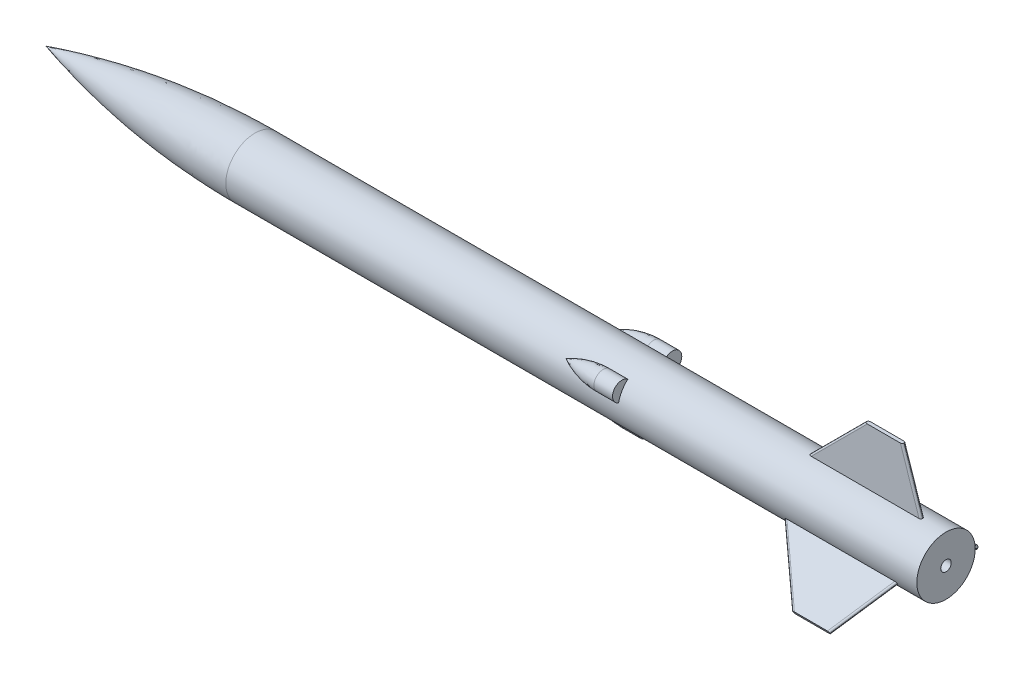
ISO-10303-21;
HEADER;
FILE_DESCRIPTION(('STEP AP214'),'2;1');
FILE_NAME('part.step','',(''),(''),'','','');
FILE_SCHEMA(('AUTOMOTIVE_DESIGN { 1 0 10303 214 1 1 1 1 }'));
ENDSEC;
DATA;
#1=APPLICATION_CONTEXT('core data for automotive mechanical design processes');
#2=APPLICATION_PROTOCOL_DEFINITION('international standard','automotive_design',2000,#1);
#3=PRODUCT_CONTEXT('',#1,'mechanical');
#4=PRODUCT('Part','Part','',(#3));
#5=PRODUCT_RELATED_PRODUCT_CATEGORY('part','',(#4));
#6=PRODUCT_DEFINITION_FORMATION('','',#4);
#7=PRODUCT_DEFINITION_CONTEXT('part definition',#1,'design');
#8=PRODUCT_DEFINITION('design','',#6,#7);
#9=PRODUCT_DEFINITION_SHAPE('','',#8);
#10=(LENGTH_UNIT() NAMED_UNIT(*) SI_UNIT(.MILLI.,.METRE.));
#11=(NAMED_UNIT(*) PLANE_ANGLE_UNIT() SI_UNIT($,.RADIAN.));
#12=(NAMED_UNIT(*) SI_UNIT($,.STERADIAN.) SOLID_ANGLE_UNIT());
#13=UNCERTAINTY_MEASURE_WITH_UNIT(LENGTH_MEASURE(1.E-05),#10,'distance_accuracy_value','');
#14=(GEOMETRIC_REPRESENTATION_CONTEXT(3) GLOBAL_UNCERTAINTY_ASSIGNED_CONTEXT((#13)) GLOBAL_UNIT_ASSIGNED_CONTEXT((#10,
#11,#12)) REPRESENTATION_CONTEXT('',''));
#15=CARTESIAN_POINT('',(0.,0.,0.));
#16=DIRECTION('',(0.,0.,1.));
#17=DIRECTION('',(1.,0.,0.));
#18=AXIS2_PLACEMENT_3D('',#15,#16,#17);
#19=CARTESIAN_POINT('',(313.266666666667,0.,0.));
#20=DIRECTION('',(-1.,0.,0.));
#21=DIRECTION('',(0.,0.,1.));
#22=AXIS2_PLACEMENT_3D('',#19,#20,#21);
#23=CYLINDRICAL_SURFACE('',#22,13.2291666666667);
#24=CARTESIAN_POINT('',(177.800000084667,0.,0.));
#25=DIRECTION('',(-1.,0.,0.));
#26=DIRECTION('',(0.,0.,1.));
#27=AXIS2_PLACEMENT_3D('',#24,#25,#26);
#28=CIRCLE('',#27,13.2291666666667);
#29=CARTESIAN_POINT('',(177.800000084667,2.65697364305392,12.959604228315));
#30=VERTEX_POINT('',#29);
#31=CARTESIAN_POINT('',(177.800000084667,9.89485966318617,8.78080878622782));
#32=VERTEX_POINT('',#31);
#33=EDGE_CURVE('E211',#30,#32,#28,.T.);
#34=ORIENTED_EDGE('',*,*,#33,.F.);
#35=DIRECTION('',(1.,0.,0.));
#36=VECTOR('',#35,1.);
#37=CARTESIAN_POINT('',(173.566666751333,2.65697364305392,12.959604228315));
#38=LINE('',#37,#36);
#39=CARTESIAN_POINT('',(169.333333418,2.65697364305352,12.9596042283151));
#40=VERTEX_POINT('',#39);
#41=EDGE_CURVE('E261',#40,#30,#38,.T.);
#42=ORIENTED_EDGE('',*,*,#41,.F.);
#43=CARTESIAN_POINT('',(152.467733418,6.61458333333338,11.4567944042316));
#44=CARTESIAN_POINT('',(152.467951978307,6.61448192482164,11.4568529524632));
#45=CARTESIAN_POINT('',(152.468170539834,6.61438051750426,11.4569114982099));
#46=CARTESIAN_POINT('',(152.468529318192,6.61421405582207,11.4570075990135));
#47=CARTESIAN_POINT('',(152.468669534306,6.61414900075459,11.4570451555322));
#48=CARTESIAN_POINT('',(152.469370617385,6.6138237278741,11.4572329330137));
#49=CARTESIAN_POINT('',(152.469931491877,6.61356351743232,11.4573831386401));
#50=CARTESIAN_POINT('',(152.472735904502,6.61226250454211,11.4581340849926));
#51=CARTESIAN_POINT('',(152.474979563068,6.61122182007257,11.4587345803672));
#52=CARTESIAN_POINT('',(152.486198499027,6.60601902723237,11.4617357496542));
#53=CARTESIAN_POINT('',(152.495175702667,6.60185880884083,11.4641324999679));
#54=CARTESIAN_POINT('',(152.540072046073,6.58106781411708,11.476095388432));
#55=CARTESIAN_POINT('',(152.576021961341,6.56446742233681,11.4855988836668));
#56=CARTESIAN_POINT('',(152.755938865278,6.48162858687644,11.5327862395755));
#57=CARTESIAN_POINT('',(152.900395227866,6.41588536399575,11.5694763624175));
#58=CARTESIAN_POINT('',(153.335427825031,6.22029473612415,11.6765101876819));
#59=CARTESIAN_POINT('',(153.627534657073,6.09214908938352,11.7437803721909));
#60=CARTESIAN_POINT('',(154.215616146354,5.84095923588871,11.8707136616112));
#61=CARTESIAN_POINT('',(154.511591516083,5.71791598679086,11.9303753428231));
#62=CARTESIAN_POINT('',(155.409048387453,5.35559728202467,12.0995825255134));
#63=CARTESIAN_POINT('',(156.016091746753,5.12493001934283,12.1983902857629));
#64=CARTESIAN_POINT('',(157.24307872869,4.69011702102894,12.3720849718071));
#65=CARTESIAN_POINT('',(157.863025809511,4.48597850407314,12.4469653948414));
#66=CARTESIAN_POINT('',(159.114943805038,4.10683874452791,12.5771608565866));
#67=CARTESIAN_POINT('',(159.746933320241,3.9318874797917,12.6324425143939));
#68=CARTESIAN_POINT('',(161.020099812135,3.61381482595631,12.727087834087));
#69=CARTESIAN_POINT('',(161.661277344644,3.47069537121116,12.7664505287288));
#70=CARTESIAN_POINT('',(162.793023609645,3.24894368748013,12.8243860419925));
#71=CARTESIAN_POINT('',(163.282055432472,3.16310109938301,12.8456891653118));
#72=CARTESIAN_POINT('',(164.263440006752,3.01110834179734,12.8821661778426));
#73=CARTESIAN_POINT('',(164.755792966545,2.94495941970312,12.8973396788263));
#74=CARTESIAN_POINT('',(165.743067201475,2.83276679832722,12.9224450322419));
#75=CARTESIAN_POINT('',(166.237989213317,2.78672922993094,12.9323752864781));
#76=CARTESIAN_POINT('',(167.229379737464,2.71507071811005,12.9476092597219));
#77=CARTESIAN_POINT('',(167.725848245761,2.68944972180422,12.9529129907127));
#78=CARTESIAN_POINT('',(168.720243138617,2.65875531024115,12.9592483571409));
#79=CARTESIAN_POINT('',(169.218170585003,2.6537148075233,12.9602731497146));
#80=CARTESIAN_POINT('',(170.213796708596,2.66430132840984,12.9581007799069));
#81=CARTESIAN_POINT('',(170.711495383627,2.67992854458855,12.9549035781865));
#82=CARTESIAN_POINT('',(171.705696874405,2.73175456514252,12.9440749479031));
#83=CARTESIAN_POINT('',(172.202199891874,2.76794961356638,12.9364443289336));
#84=CARTESIAN_POINT('',(172.945416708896,2.83749569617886,12.9213008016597));
#85=CARTESIAN_POINT('',(173.192904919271,2.8632207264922,12.9156365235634));
#86=CARTESIAN_POINT('',(173.687272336,2.91971365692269,12.9029821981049));
#87=CARTESIAN_POINT('',(173.93415153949,2.95048158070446,12.8959921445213));
#88=CARTESIAN_POINT('',(174.180678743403,2.98374995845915,12.8882926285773));
#89=B_SPLINE_CURVE_WITH_KNOTS('',3,(#43,#44,#45,#46,#47,#48,#49,#50,#51,#52,#53,#54,#55,#56,#57,
#58,#59,#60,#61,#62,#63,#64,#65,#66,#67,#68,#69,#70,#71,#72,#73,#74,#75,#76,#77,#78,#79,#80,#81,
#82,#83,#84,#85,#86,#87,#88),.UNSPECIFIED.,.F.,.F.,(4,2,2,2,2,2,2,2,2,2,2,2,2,2,2,2,2,2,2,2,2,2,
4),(0.,0.000743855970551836,0.00122106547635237,0.00312990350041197,0.0107652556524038,
0.0413066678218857,0.163472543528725,0.65215035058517,1.62996039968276,2.60795314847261,
4.5773008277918,6.54718326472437,8.52040489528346,10.4937464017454,11.9842306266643,
13.4748092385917,14.9658419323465,16.4568707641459,17.950283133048,19.4437094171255,
20.9368630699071,21.683473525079,22.4300874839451),.UNSPECIFIED.);
#90=CARTESIAN_POINT('',(152.467733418,6.61458333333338,11.4567944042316));
#91=VERTEX_POINT('',#90);
#92=EDGE_CURVE('E255',#91,#40,#89,.T.);
#93=ORIENTED_EDGE('',*,*,#92,.F.);
#94=CARTESIAN_POINT('',(152.467733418,6.61458333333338,11.4567944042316));
#95=CARTESIAN_POINT('',(152.467951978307,6.61468474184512,11.4567358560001));
#96=CARTESIAN_POINT('',(152.468170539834,6.6147861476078,11.4566773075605));
#97=CARTESIAN_POINT('',(152.468529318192,6.6149526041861,11.4565811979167));
#98=CARTESIAN_POINT('',(152.468669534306,6.61501765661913,11.456543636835));
#99=CARTESIAN_POINT('',(152.469370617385,6.61534291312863,11.4563558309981));
#100=CARTESIAN_POINT('',(152.469931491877,6.61560310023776,11.4562055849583));
#101=CARTESIAN_POINT('',(152.472735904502,6.61690394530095,11.455454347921));
#102=CARTESIAN_POINT('',(152.474979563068,6.61794433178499,11.4548533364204));
#103=CARTESIAN_POINT('',(152.486198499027,6.62314481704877,11.4518481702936));
#104=CARTESIAN_POINT('',(152.495175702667,6.62730057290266,11.4494436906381));
#105=CARTESIAN_POINT('',(152.540072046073,6.64805623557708,11.4374196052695));
#106=CARTESIAN_POINT('',(152.576021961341,6.66458669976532,11.4277949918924));
#107=CARTESIAN_POINT('',(152.755938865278,6.74687156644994,11.3796481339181));
#108=CARTESIAN_POINT('',(152.900395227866,6.81151775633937,11.3410578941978));
#109=CARTESIAN_POINT('',(153.335427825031,7.00200708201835,11.2251883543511));
#110=CARTESIAN_POINT('',(153.627534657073,7.12433759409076,11.1478460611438));
#111=CARTESIAN_POINT('',(154.215616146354,7.35985997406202,10.9937759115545));
#112=CARTESIAN_POINT('',(154.511591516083,7.47305013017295,10.9170481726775));
#113=CARTESIAN_POINT('',(155.409048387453,7.80074720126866,10.6878745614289));
#114=CARTESIAN_POINT('',(156.016091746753,8.00165086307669,10.5375147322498));
#115=CARTESIAN_POINT('',(157.24307872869,8.36948137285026,10.2478029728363));
#116=CARTESIAN_POINT('',(157.863025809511,8.53639897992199,10.1084540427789));
#117=CARTESIAN_POINT('',(159.114943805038,8.83872143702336,9.84520711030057));
#118=CARTESIAN_POINT('',(159.746933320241,8.97407238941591,9.72133569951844));
#119=CARTESIAN_POINT('',(161.020099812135,9.21507396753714,9.49319936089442));
#120=CARTESIAN_POINT('',(161.661277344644,9.32072278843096,9.38893562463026));
#121=CARTESIAN_POINT('',(162.793023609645,9.48177225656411,9.22586078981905));
#122=CARTESIAN_POINT('',(163.282055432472,9.54314259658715,9.16217048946));
#123=CARTESIAN_POINT('',(164.263440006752,9.65072899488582,9.04877940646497));
#124=CARTESIAN_POINT('',(164.755792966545,9.69694409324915,8.99907950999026));
#125=CARTESIAN_POINT('',(165.743067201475,9.77478227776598,8.91447052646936));
#126=CARTESIAN_POINT('',(166.237989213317,9.80640091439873,8.87956594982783));
#127=CARTESIAN_POINT('',(167.229379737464,9.85542317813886,8.82512484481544));
#128=CARTESIAN_POINT('',(167.725848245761,9.87282684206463,8.80558827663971));
#129=CARTESIAN_POINT('',(168.720243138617,9.89366063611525,8.78217381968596));
#130=CARTESIAN_POINT('',(169.218170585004,9.89706838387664,8.77832101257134));
#131=CARTESIAN_POINT('',(170.213796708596,9.88989379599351,8.78640302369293));
#132=CARTESIAN_POINT('',(170.711495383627,9.87931132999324,8.79833798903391));
#133=CARTESIAN_POINT('',(171.705696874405,9.84402045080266,8.83780632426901));
#134=CARTESIAN_POINT('',(172.202199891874,9.81931461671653,8.86533684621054));
#135=CARTESIAN_POINT('',(172.945416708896,9.77142689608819,8.91799375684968));
#136=CARTESIAN_POINT('',(173.192904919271,9.75365897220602,8.93744014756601));
#137=CARTESIAN_POINT('',(173.687272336,9.71445353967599,8.9800372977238));
#138=CARTESIAN_POINT('',(173.93415153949,9.69301601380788,9.0031880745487));
#139=CARTESIAN_POINT('',(174.180678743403,9.66971384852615,9.02814957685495));
#140=B_SPLINE_CURVE_WITH_KNOTS('',3,(#94,#95,#96,#97,#98,#99,#100,#101,#102,#103,#104,#105,#106,
#107,#108,#109,#110,#111,#112,#113,#114,#115,#116,#117,#118,#119,#120,#121,#122,#123,#124,#125,
#126,#127,#128,#129,#130,#131,#132,#133,#134,#135,#136,#137,#138,#139),.UNSPECIFIED.,.F.,.F.,(4,
2,2,2,2,2,2,2,2,2,2,2,2,2,2,2,2,2,2,2,2,2,4),(0.,0.000743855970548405,0.00122106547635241,
0.00312990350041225,0.0107652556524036,0.0413066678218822,0.163472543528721,0.65215035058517,
1.62996039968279,2.60795314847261,4.5773008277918,6.5471832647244,8.52040489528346,
10.4937464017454,11.9842306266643,13.4748092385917,14.9658419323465,16.456870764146,
17.9502831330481,19.4437094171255,20.9368630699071,21.683473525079,22.4300874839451),.UNSPECIFIED.);
#141=CARTESIAN_POINT('',(169.333333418,9.89485966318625,8.78080878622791));
#142=VERTEX_POINT('',#141);
#143=EDGE_CURVE('E249',#142,#91,#140,.F.);
#144=ORIENTED_EDGE('',*,*,#143,.F.);
#145=DIRECTION('',(1.,0.,0.));
#146=VECTOR('',#145,1.);
#147=CARTESIAN_POINT('',(173.566666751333,9.89485966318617,8.78080878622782));
#148=LINE('',#147,#146);
#149=EDGE_CURVE('E214',#32,#142,#148,.F.);
#150=ORIENTED_EDGE('',*,*,#149,.F.);
#151=EDGE_LOOP('',(#34,#42,#93,#144,#150));
#152=FACE_BOUND('',#151,.T.);
#153=CARTESIAN_POINT('',(252.982031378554,-7.2900740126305,11.0392785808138));
#154=CARTESIAN_POINT('',(252.940095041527,-7.29006694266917,11.0392815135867));
#155=CARTESIAN_POINT('',(252.898149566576,-7.28868425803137,11.0401962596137));
#156=CARTESIAN_POINT('',(252.814465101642,-7.28307277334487,11.0438998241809));
#157=CARTESIAN_POINT('',(252.772726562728,-7.2788393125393,11.0466917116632));
#158=CARTESIAN_POINT('',(252.689408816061,-7.26737421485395,11.0542375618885));
#159=CARTESIAN_POINT('',(252.647835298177,-7.26011324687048,11.0590107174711));
#160=CARTESIAN_POINT('',(252.565679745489,-7.24245694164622,11.0705817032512));
#161=CARTESIAN_POINT('',(252.525096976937,-7.2320640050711,11.0773779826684));
#162=CARTESIAN_POINT('',(252.430198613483,-7.20339607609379,11.0960504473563));
#163=CARTESIAN_POINT('',(252.376503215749,-7.18362663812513,11.108875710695));
#164=CARTESIAN_POINT('',(252.273499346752,-7.13731741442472,11.1386851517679));
#165=CARTESIAN_POINT('',(252.224175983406,-7.11080190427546,11.1556544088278));
#166=CARTESIAN_POINT('',(252.142671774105,-7.05750375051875,11.1894253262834));
#167=CARTESIAN_POINT('',(252.109165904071,-7.0322042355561,11.2053562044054));
#168=CARTESIAN_POINT('',(252.047337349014,-6.97723828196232,11.2396638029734));
#169=CARTESIAN_POINT('',(252.019010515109,-6.94757537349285,11.2580385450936));
#170=CARTESIAN_POINT('',(251.97377595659,-6.88997757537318,11.2933600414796));
#171=CARTESIAN_POINT('',(251.955726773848,-6.86272333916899,11.3099507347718));
#172=CARTESIAN_POINT('',(251.925173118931,-6.8059197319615,11.3442232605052));
#173=CARTESIAN_POINT('',(251.912657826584,-6.77637497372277,11.3619028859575));
#174=CARTESIAN_POINT('',(251.896745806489,-6.72471859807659,11.3925249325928));
#175=CARTESIAN_POINT('',(251.891745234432,-6.70300300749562,11.4053161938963));
#176=CARTESIAN_POINT('',(251.885026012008,-6.65907311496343,11.4310216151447));
#177=CARTESIAN_POINT('',(251.883315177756,-6.63685775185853,11.4439359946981));
#178=CARTESIAN_POINT('',(251.883333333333,-6.61458333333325,11.4567944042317));
#179=B_SPLINE_CURVE_WITH_KNOTS('',3,(#153,#154,#155,#156,#157,#158,#159,#160,#161,#162,#163,
#164,#165,#166,#167,#168,#169,#170,#171,#172,#173,#174,#175,#176,#177,#178),.UNSPECIFIED.,.F.,
.F.,(4,2,2,2,2,2,2,2,2,2,2,2,4),(0.,0.125790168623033,0.251786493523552,0.379032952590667,
0.506182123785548,0.681487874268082,0.85617149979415,0.990412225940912,1.1245449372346,
1.23408000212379,1.34339994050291,1.42027828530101,1.49733906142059),.UNSPECIFIED.);
#180=CARTESIAN_POINT('',(252.982031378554,-7.2900740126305,11.0392785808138));
#181=VERTEX_POINT('',#180);
#182=CARTESIAN_POINT('',(251.883333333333,-6.61458333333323,11.4567944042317));
#183=VERTEX_POINT('',#182);
#184=EDGE_CURVE('E444',#181,#183,#179,.T.);
#185=ORIENTED_EDGE('',*,*,#184,.T.);
#186=CARTESIAN_POINT('',(251.883333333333,-6.61458333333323,11.4567944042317));
#187=CARTESIAN_POINT('',(251.883330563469,-6.59883769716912,11.4658854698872));
#188=CARTESIAN_POINT('',(251.884180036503,-6.58308227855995,11.4749382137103));
#189=CARTESIAN_POINT('',(251.887549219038,-6.55167965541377,11.4928965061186));
#190=CARTESIAN_POINT('',(251.89006785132,-6.53603238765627,11.501802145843));
#191=CARTESIAN_POINT('',(251.9000223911,-6.48967196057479,11.5280639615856));
#192=CARTESIAN_POINT('',(251.909858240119,-6.45927474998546,11.5451181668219));
#193=CARTESIAN_POINT('',(251.935245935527,-6.40035362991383,11.5778868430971));
#194=CARTESIAN_POINT('',(251.950785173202,-6.37182575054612,11.5936041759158));
#195=CARTESIAN_POINT('',(251.986716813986,-6.31707664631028,11.6235265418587));
#196=CARTESIAN_POINT('',(252.007118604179,-6.29086001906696,11.6377285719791));
#197=CARTESIAN_POINT('',(252.059877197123,-6.23219030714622,11.6692814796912));
#198=CARTESIAN_POINT('',(252.093899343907,-6.2008635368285,11.6859400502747));
#199=CARTESIAN_POINT('',(252.167215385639,-6.14338560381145,11.7162589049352));
#200=CARTESIAN_POINT('',(252.206517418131,-6.11724258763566,11.7299144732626));
#201=CARTESIAN_POINT('',(252.303308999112,-6.06174547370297,11.7587156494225));
#202=CARTESIAN_POINT('',(252.362340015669,-6.03448561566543,11.7727016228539));
#203=CARTESIAN_POINT('',(252.484580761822,-5.98862587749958,11.7960953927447));
#204=CARTESIAN_POINT('',(252.547800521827,-5.97004771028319,11.8054917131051));
#205=CARTESIAN_POINT('',(252.672743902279,-5.94185001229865,11.8197087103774));
#206=CARTESIAN_POINT('',(252.734340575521,-5.93177215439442,11.8247637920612));
#207=CARTESIAN_POINT('',(252.857993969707,-5.91851590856,11.8313998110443));
#208=CARTESIAN_POINT('',(252.920043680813,-5.91528588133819,11.8330067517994));
#209=CARTESIAN_POINT('',(252.982031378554,-5.9152586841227,11.8330285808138));
#210=B_SPLINE_CURVE_WITH_KNOTS('',3,(#186,#187,#188,#189,#190,#191,#192,#193,#194,#195,#196,
#197,#198,#199,#200,#201,#202,#203,#204,#205,#206,#207,#208,#209),.UNSPECIFIED.,.F.,.F.,(4,2,2,
2,2,2,2,2,2,2,2,4),(0.,0.0545047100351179,0.108974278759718,0.217008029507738,0.324804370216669,
0.432810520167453,0.579473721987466,0.726365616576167,0.924821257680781,1.12377061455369,
1.31114512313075,1.49710154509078),.UNSPECIFIED.);
#211=CARTESIAN_POINT('',(252.982031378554,-5.9152586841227,11.8330285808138));
#212=VERTEX_POINT('',#211);
#213=EDGE_CURVE('E450',#183,#212,#210,.T.);
#214=ORIENTED_EDGE('',*,*,#213,.T.);
#215=DIRECTION('',(-1.,0.,0.));
#216=VECTOR('',#215,1.);
#217=CARTESIAN_POINT('',(313.266666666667,-5.9152586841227,11.8330285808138));
#218=LINE('',#217,#216);
#219=CARTESIAN_POINT('',(301.85474580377,-5.9152586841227,11.8330285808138));
#220=VERTEX_POINT('',#219);
#221=EDGE_CURVE('E531',#212,#220,#218,.F.);
#222=ORIENTED_EDGE('',*,*,#221,.T.);
#223=CARTESIAN_POINT('',(301.85474580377,-5.9152586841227,11.8330285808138));
#224=CARTESIAN_POINT('',(301.903071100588,-5.91522558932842,11.8330366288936));
#225=CARTESIAN_POINT('',(301.951411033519,-5.91881798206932,11.8312490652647));
#226=CARTESIAN_POINT('',(302.046807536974,-5.93310823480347,11.8240938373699));
#227=CARTESIAN_POINT('',(302.093862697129,-5.94381360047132,11.818722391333));
#228=CARTESIAN_POINT('',(302.185331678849,-5.97220314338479,11.8044007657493));
#229=CARTESIAN_POINT('',(302.229741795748,-5.98989685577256,11.7954456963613));
#230=CARTESIAN_POINT('',(302.314418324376,-6.03182079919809,11.7740623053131));
#231=CARTESIAN_POINT('',(302.354688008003,-6.05604581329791,11.7616367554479));
#232=CARTESIAN_POINT('',(302.42856370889,-6.10950227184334,11.733955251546));
#233=CARTESIAN_POINT('',(302.462340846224,-6.13855011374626,11.7188018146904));
#234=CARTESIAN_POINT('',(302.523635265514,-6.20131953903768,11.6857067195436));
#235=CARTESIAN_POINT('',(302.551151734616,-6.23504172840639,11.6677646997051));
#236=CARTESIAN_POINT('',(302.597936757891,-6.30460831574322,11.6303163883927));
#237=CARTESIAN_POINT('',(302.617500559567,-6.34030627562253,11.6109060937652));
#238=CARTESIAN_POINT('',(302.649287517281,-6.41392035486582,11.5704033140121));
#239=CARTESIAN_POINT('',(302.66151896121,-6.45183391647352,11.5493127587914));
#240=CARTESIAN_POINT('',(302.674354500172,-6.51080670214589,11.5161107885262));
#241=CARTESIAN_POINT('',(302.677720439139,-6.53151454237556,11.5043790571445));
#242=CARTESIAN_POINT('',(302.682208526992,-6.57301692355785,11.480717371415));
#243=CARTESIAN_POINT('',(302.683334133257,-6.59381128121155,11.4687877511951));
#244=CARTESIAN_POINT('',(302.683333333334,-6.61458333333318,11.4567944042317));
#245=B_SPLINE_CURVE_WITH_KNOTS('',3,(#223,#224,#225,#226,#227,#228,#229,#230,#231,#232,#233,
#234,#235,#236,#237,#238,#239,#240,#241,#242,#243,#244),.UNSPECIFIED.,.F.,.F.,(4,2,2,2,2,2,2,2,
2,2,4),(0.,0.14483343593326,0.289819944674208,0.435004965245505,0.580074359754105,
0.720532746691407,0.86100935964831,0.995647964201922,1.13013409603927,1.2021515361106,
1.27405774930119),.UNSPECIFIED.);
#246=CARTESIAN_POINT('',(302.683333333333,-6.61458333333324,11.4567944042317));
#247=VERTEX_POINT('',#246);
#248=EDGE_CURVE('E451',#220,#247,#245,.T.);
#249=ORIENTED_EDGE('',*,*,#248,.T.);
#250=CARTESIAN_POINT('',(302.683333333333,-6.61458333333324,11.4567944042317));
#251=CARTESIAN_POINT('',(302.683375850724,-6.65223382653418,11.4350664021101));
#252=CARTESIAN_POINT('',(302.679644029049,-6.68975305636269,11.4131480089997));
#253=CARTESIAN_POINT('',(302.664953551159,-6.76345479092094,11.3696218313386));
#254=CARTESIAN_POINT('',(302.654006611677,-6.7996393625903,11.3480136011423));
#255=CARTESIAN_POINT('',(302.625202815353,-6.86973352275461,11.3057200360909));
#256=CARTESIAN_POINT('',(302.607344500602,-6.90364262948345,11.2850348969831));
#257=CARTESIAN_POINT('',(302.565302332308,-6.96830189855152,11.2452238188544));
#258=CARTESIAN_POINT('',(302.54111817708,-6.99905191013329,11.2260979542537));
#259=CARTESIAN_POINT('',(302.486825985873,-7.05701676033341,11.1897521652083));
#260=CARTESIAN_POINT('',(302.456647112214,-7.08418214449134,11.1725593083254));
#261=CARTESIAN_POINT('',(302.391473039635,-7.13391674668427,11.1408686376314));
#262=CARTESIAN_POINT('',(302.356476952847,-7.15648511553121,11.1263713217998));
#263=CARTESIAN_POINT('',(302.281450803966,-7.19724704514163,11.100049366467));
#264=CARTESIAN_POINT('',(302.241292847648,-7.21527191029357,11.0883285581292));
#265=CARTESIAN_POINT('',(302.158037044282,-7.2456396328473,11.0685087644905));
#266=CARTESIAN_POINT('',(302.114938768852,-7.25798166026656,11.0604103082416));
#267=CARTESIAN_POINT('',(302.035653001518,-7.27495920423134,11.0492490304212));
#268=CARTESIAN_POINT('',(301.999776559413,-7.28063388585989,11.0455085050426));
#269=CARTESIAN_POINT('',(301.927516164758,-7.28819053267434,11.0405223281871));
#270=CARTESIAN_POINT('',(301.891133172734,-7.29007889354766,11.0392724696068));
#271=CARTESIAN_POINT('',(301.85474580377,-7.2900740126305,11.0392785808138));
#272=B_SPLINE_CURVE_WITH_KNOTS('',3,(#250,#251,#252,#253,#254,#255,#256,#257,#258,#259,#260,
#261,#262,#263,#264,#265,#266,#267,#268,#269,#270,#271),.UNSPECIFIED.,.F.,.F.,(4,2,2,2,2,2,2,2,
2,2,4),(0.,0.130222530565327,0.260234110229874,0.390273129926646,0.520318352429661,
0.652003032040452,0.783712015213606,0.919761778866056,1.05583140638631,1.16509703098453,
1.27417793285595),.UNSPECIFIED.);
#273=CARTESIAN_POINT('',(301.85474580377,-7.2900740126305,11.0392785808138));
#274=VERTEX_POINT('',#273);
#275=EDGE_CURVE('E629',#247,#274,#272,.T.);
#276=ORIENTED_EDGE('',*,*,#275,.T.);
#277=DIRECTION('',(-1.,0.,0.));
#278=VECTOR('',#277,1.);
#279=CARTESIAN_POINT('',(313.266666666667,-7.2900740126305,11.0392785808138));
#280=LINE('',#279,#278);
#281=EDGE_CURVE('E534',#181,#274,#280,.F.);
#282=ORIENTED_EDGE('',*,*,#281,.F.);
#283=EDGE_LOOP('',(#185,#214,#222,#249,#276,#282));
#284=FACE_BOUND('',#283,.T.);
#285=CARTESIAN_POINT('',(252.982031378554,13.2053326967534,0.79375));
#286=CARTESIAN_POINT('',(252.940095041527,13.2053317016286,0.793742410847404));
#287=CARTESIAN_POINT('',(252.898149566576,13.2054325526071,0.792087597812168));
#288=CARTESIAN_POINT('',(252.814465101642,13.2058341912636,0.785376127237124));
#289=CARTESIAN_POINT('',(252.772726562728,13.206135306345,0.780313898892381));
#290=CARTESIAN_POINT('',(252.689408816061,13.2069376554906,0.766611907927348));
#291=CARTESIAN_POINT('',(252.647835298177,13.2074408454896,0.757937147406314));
#292=CARTESIAN_POINT('',(252.565679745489,13.2086334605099,0.736860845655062));
#293=CARTESIAN_POINT('',(252.525096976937,13.2093227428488,0.724462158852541));
#294=CARTESIAN_POINT('',(252.430198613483,13.2111596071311,0.690298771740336));
#295=CARTESIAN_POINT('',(252.376503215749,13.2123818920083,0.666765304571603));
#296=CARTESIAN_POINT('',(252.273499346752,13.2150430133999,0.61175561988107));
#297=CARTESIAN_POINT('',(252.224175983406,13.2164810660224,0.580307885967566));
#298=CARTESIAN_POINT('',(252.142671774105,13.2190784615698,0.517264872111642));
#299=CARTESIAN_POINT('',(252.109165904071,13.2202252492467,0.487389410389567));
#300=CARTESIAN_POINT('',(252.047337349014,13.2224535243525,0.422633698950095));
#301=CARTESIAN_POINT('',(252.019010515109,13.2235350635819,0.387757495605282));
#302=CARTESIAN_POINT('',(251.97377595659,13.225325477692,0.32021559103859));
#303=CARTESIAN_POINT('',(251.955726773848,13.2260663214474,0.288317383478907));
#304=CARTESIAN_POINT('',(251.925173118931,13.2273453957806,0.221987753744));
#305=CARTESIAN_POINT('',(251.912657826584,13.2278840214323,0.187561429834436));
#306=CARTESIAN_POINT('',(251.896745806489,13.2285753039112,0.127514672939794));
#307=CARTESIAN_POINT('',(251.891745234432,13.228795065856,0.102312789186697));
#308=CARTESIAN_POINT('',(251.885026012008,13.2290916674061,0.0514156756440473));
#309=CARTESIAN_POINT('',(251.883315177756,13.2291681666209,0.0257194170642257));
#310=CARTESIAN_POINT('',(251.883333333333,13.2291666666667,0.));
#311=B_SPLINE_CURVE_WITH_KNOTS('',3,(#285,#286,#287,#288,#289,#290,#291,#292,#293,#294,#295,
#296,#297,#298,#299,#300,#301,#302,#303,#304,#305,#306,#307,#308,#309,#310),.UNSPECIFIED.,.F.,
.F.,(4,2,2,2,2,2,2,2,2,2,2,2,4),(0.,0.125790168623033,0.251786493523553,0.379032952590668,
0.506182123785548,0.681487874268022,0.856171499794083,0.990412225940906,1.1245449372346,
1.23408000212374,1.34339994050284,1.42027828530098,1.49733906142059),.UNSPECIFIED.);
#312=CARTESIAN_POINT('',(252.982031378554,13.2053326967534,0.79375));
#313=VERTEX_POINT('',#312);
#314=CARTESIAN_POINT('',(251.883333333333,13.2291666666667,0.));
#315=VERTEX_POINT('',#314);
#316=EDGE_CURVE('E485',#313,#315,#311,.T.);
#317=ORIENTED_EDGE('',*,*,#316,.T.);
#318=CARTESIAN_POINT('',(251.883333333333,13.2291666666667,0.));
#319=CARTESIAN_POINT('',(251.883330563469,13.2291669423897,-0.0181816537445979));
#320=CARTESIAN_POINT('',(251.884180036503,13.22912913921,-0.0363526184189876));
#321=CARTESIAN_POINT('',(251.887549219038,13.228980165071,-0.0725272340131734));
#322=CARTESIAN_POINT('',(251.89006785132,13.2288690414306,-0.090530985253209));
#323=CARTESIAN_POINT('',(251.9000223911,13.2284322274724,-0.143811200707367));
#324=CARTESIAN_POINT('',(251.909858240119,13.2280029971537,-0.178663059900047));
#325=CARTESIAN_POINT('',(251.935245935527,13.2269209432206,-0.2460745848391));
#326=CARTESIAN_POINT('',(251.950785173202,13.2262686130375,-0.278639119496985));
#327=CARTESIAN_POINT('',(251.986716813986,13.2248075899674,-0.341014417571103));
#328=CARTESIAN_POINT('',(252.007118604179,13.2239985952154,-0.370819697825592));
#329=CARTESIAN_POINT('',(252.059877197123,13.221989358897,-0.437405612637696));
#330=CARTESIAN_POINT('',(252.093899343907,13.2207527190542,-0.472864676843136));
#331=CARTESIAN_POINT('',(252.167215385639,13.2182706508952,-0.537801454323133));
#332=CARTESIAN_POINT('',(252.206517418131,13.217025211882,-0.567269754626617));
#333=CARTESIAN_POINT('',(252.303308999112,13.214219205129,-0.62973225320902));
#334=CARTESIAN_POINT('',(252.362340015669,13.2127014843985,-0.660332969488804));
#335=CARTESIAN_POINT('',(252.484580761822,13.2100312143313,-0.71174555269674));
#336=CARTESIAN_POINT('',(252.547800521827,13.2088795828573,-0.732532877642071));
#337=CARTESIAN_POINT('',(252.672743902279,13.2070930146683,-0.764061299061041));
#338=CARTESIAN_POINT('',(252.734340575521,13.2064319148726,-0.775316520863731));
#339=CARTESIAN_POINT('',(252.857993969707,13.2055507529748,-0.790114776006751));
#340=CARTESIAN_POINT('',(252.920043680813,13.2053273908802,-0.793715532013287));
#341=CARTESIAN_POINT('',(252.982031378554,13.2053326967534,-0.79375));
#342=B_SPLINE_CURVE_WITH_KNOTS('',3,(#318,#319,#320,#321,#322,#323,#324,#325,#326,#327,#328,
#329,#330,#331,#332,#333,#334,#335,#336,#337,#338,#339,#340,#341),.UNSPECIFIED.,.F.,.F.,(4,2,2,
2,2,2,2,2,2,2,2,4),(0.,0.054504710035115,0.108974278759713,0.217008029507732,0.324804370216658,
0.432810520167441,0.579473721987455,0.726365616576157,0.924821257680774,1.12377061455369,
1.31114512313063,1.49710154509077),.UNSPECIFIED.);
#343=CARTESIAN_POINT('',(252.982031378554,13.2053326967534,-0.79375));
#344=VERTEX_POINT('',#343);
#345=EDGE_CURVE('E487',#315,#344,#342,.T.);
#346=ORIENTED_EDGE('',*,*,#345,.T.);
#347=DIRECTION('',(-1.,0.,0.));
#348=VECTOR('',#347,1.);
#349=CARTESIAN_POINT('',(313.266666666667,13.2053326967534,-0.79375));
#350=LINE('',#349,#348);
#351=CARTESIAN_POINT('',(301.85474580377,13.2053326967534,-0.79375));
#352=VERTEX_POINT('',#351);
#353=EDGE_CURVE('E328',#344,#352,#350,.F.);
#354=ORIENTED_EDGE('',*,*,#353,.T.);
#355=CARTESIAN_POINT('',(301.85474580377,13.2053326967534,-0.79375));
#356=CARTESIAN_POINT('',(301.903071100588,13.2053231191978,-0.793782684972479));
#357=CARTESIAN_POINT('',(301.951411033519,13.2055712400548,-0.789777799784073));
#358=CARTESIAN_POINT('',(302.046807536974,13.2065197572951,-0.773824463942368));
#359=CARTESIAN_POINT('',(302.093862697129,13.207220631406,-0.761867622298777));
#360=CARTESIAN_POINT('',(302.185331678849,13.2090125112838,-0.730120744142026));
#361=CARTESIAN_POINT('',(302.229741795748,13.210104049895,-0.710320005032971));
#362=CARTESIAN_POINT('',(302.314418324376,13.212547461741,-0.663321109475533));
#363=CARTESIAN_POINT('',(302.354688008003,13.2138991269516,-0.636128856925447));
#364=CARTESIAN_POINT('',(302.42856370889,13.2166544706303,-0.575993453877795));
#365=CARTESIAN_POINT('',(302.462340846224,13.2180551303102,-0.543260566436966));
#366=CARTESIAN_POINT('',(302.523635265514,13.2207786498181,-0.472353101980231));
#367=CARTESIAN_POINT('',(302.551151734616,13.2221014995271,-0.434177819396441));
#368=CARTESIAN_POINT('',(302.597936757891,13.2244536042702,-0.355207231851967));
#369=CARTESIAN_POINT('',(302.617500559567,13.2254927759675,-0.314586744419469));
#370=CARTESIAN_POINT('',(302.649287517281,13.227223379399,-0.23058369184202));
#371=CARTESIAN_POINT('',(302.66151896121,13.2279152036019,-0.187204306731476));
#372=CARTESIAN_POINT('',(302.674354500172,13.2286478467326,-0.11953139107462));
#373=CARTESIAN_POINT('',(302.677720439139,13.2288417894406,-0.0957320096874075));
#374=CARTESIAN_POINT('',(302.682208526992,13.2291013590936,-0.0479590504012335));
#375=CARTESIAN_POINT('',(302.683334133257,13.2291671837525,-0.0239857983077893));
#376=CARTESIAN_POINT('',(302.683333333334,13.2291666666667,0.));
#377=B_SPLINE_CURVE_WITH_KNOTS('',3,(#355,#356,#357,#358,#359,#360,#361,#362,#363,#364,#365,
#366,#367,#368,#369,#370,#371,#372,#373,#374,#375,#376),.UNSPECIFIED.,.F.,.F.,(4,2,2,2,2,2,2,2,
2,2,4),(0.,0.14483343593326,0.289819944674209,0.435004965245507,0.580074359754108,
0.72053274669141,0.861009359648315,0.995647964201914,1.13013409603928,1.2021515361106,
1.2740577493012),.UNSPECIFIED.);
#378=CARTESIAN_POINT('',(302.683333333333,13.2291666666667,0.));
#379=VERTEX_POINT('',#378);
#380=EDGE_CURVE('E358',#352,#379,#377,.T.);
#381=ORIENTED_EDGE('',*,*,#380,.T.);
#382=CARTESIAN_POINT('',(302.683333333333,13.2291666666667,0.));
#383=CARTESIAN_POINT('',(302.683375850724,13.2291749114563,0.0434702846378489));
#384=CARTESIAN_POINT('',(302.679644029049,13.2289526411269,0.0869220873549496));
#385=CARTESIAN_POINT('',(302.664953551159,13.2281087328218,0.172512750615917));
#386=CARTESIAN_POINT('',(302.654006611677,13.2274877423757,0.214653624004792));
#387=CARTESIAN_POINT('',(302.625202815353,13.2259075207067,0.296503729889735));
#388=CARTESIAN_POINT('',(302.607344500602,13.224948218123,0.336212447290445));
#389=CARTESIAN_POINT('',(302.565302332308,13.2228004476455,0.412114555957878));
#390=CARTESIAN_POINT('',(302.54111817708,13.2216119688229,0.448307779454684));
#391=CARTESIAN_POINT('',(302.486825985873,13.219118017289,0.516679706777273));
#392=CARTESIAN_POINT('',(302.456647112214,13.2178112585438,0.548802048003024));
#393=CARTESIAN_POINT('',(302.391473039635,13.2152336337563,0.6077188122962));
#394=CARTESIAN_POINT('',(302.356476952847,13.2139627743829,0.634512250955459));
#395=CARTESIAN_POINT('',(302.281450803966,13.2115482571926,0.682974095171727));
#396=CARTESIAN_POINT('',(302.241292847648,13.2104101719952,0.704444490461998));
#397=CARTESIAN_POINT('',(302.158037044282,13.2084295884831,0.740653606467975));
#398=CARTESIAN_POINT('',(302.114938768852,13.2075871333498,0.7553913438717));
#399=CARTESIAN_POINT('',(302.035653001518,13.206409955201,0.775674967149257));
#400=CARTESIAN_POINT('',(301.999776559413,13.2060079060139,0.782459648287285));
#401=CARTESIAN_POINT('',(301.927516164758,13.2054680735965,0.791496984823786));
#402=CARTESIAN_POINT('',(301.891133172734,13.2053298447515,0.793757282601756));
#403=CARTESIAN_POINT('',(301.85474580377,13.2053326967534,0.79375));
#404=B_SPLINE_CURVE_WITH_KNOTS('',3,(#382,#383,#384,#385,#386,#387,#388,#389,#390,#391,#392,
#393,#394,#395,#396,#397,#398,#399,#400,#401,#402,#403),.UNSPECIFIED.,.F.,.F.,(4,2,2,2,2,2,2,2,
2,2,4),(0.,0.130222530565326,0.260234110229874,0.390273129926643,0.520318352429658,
0.65200303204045,0.783712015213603,0.919761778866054,1.05583140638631,1.16509703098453,
1.27417793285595),.UNSPECIFIED.);
#405=CARTESIAN_POINT('',(301.85474580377,13.2053326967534,0.79375));
#406=VERTEX_POINT('',#405);
#407=EDGE_CURVE('E352',#379,#406,#404,.T.);
#408=ORIENTED_EDGE('',*,*,#407,.T.);
#409=DIRECTION('',(-1.,0.,0.));
#410=VECTOR('',#409,1.);
#411=CARTESIAN_POINT('',(313.266666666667,13.2053326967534,0.79375));
#412=LINE('',#411,#410);
#413=EDGE_CURVE('E331',#313,#406,#412,.F.);
#414=ORIENTED_EDGE('',*,*,#413,.F.);
#415=EDGE_LOOP('',(#317,#346,#354,#381,#408,#414));
#416=FACE_BOUND('',#415,.T.);
#417=CARTESIAN_POINT('',(313.266666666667,0.,0.));
#418=DIRECTION('',(1.,0.,0.));
#419=DIRECTION('',(0.,0.,-1.));
#420=AXIS2_PLACEMENT_3D('',#417,#418,#419);
#421=CIRCLE('',#420,13.2291666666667);
#422=CARTESIAN_POINT('',(313.266666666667,0.,-13.2291666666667));
#423=VERTEX_POINT('',#422);
#424=EDGE_CURVE('E325',#423,#423,#421,.T.);
#425=ORIENTED_EDGE('',*,*,#424,.F.);
#426=EDGE_LOOP('',(#425));
#427=FACE_BOUND('',#426,.T.);
#428=CARTESIAN_POINT('',(0.,0.,0.));
#429=DIRECTION('',(1.,0.,0.));
#430=DIRECTION('',(0.,1.,0.));
#431=AXIS2_PLACEMENT_3D('',#428,#429,#430);
#432=CIRCLE('',#431,13.2291666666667);
#433=CARTESIAN_POINT('',(0.,13.2291666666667,0.));
#434=VERTEX_POINT('',#433);
#435=EDGE_CURVE('E322',#434,#434,#432,.T.);
#436=ORIENTED_EDGE('',*,*,#435,.T.);
#437=EDGE_LOOP('',(#436));
#438=FACE_BOUND('',#437,.T.);
#439=CARTESIAN_POINT('',(252.982031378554,-5.91525868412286,-11.8330285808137));
#440=CARTESIAN_POINT('',(252.940095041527,-5.91526475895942,-11.833023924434));
#441=CARTESIAN_POINT('',(252.898149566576,-5.91674829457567,-11.8322838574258));
#442=CARTESIAN_POINT('',(252.814465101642,-5.92276141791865,-11.8292759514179));
#443=CARTESIAN_POINT('',(252.772726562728,-5.92729599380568,-11.8270056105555));
#444=CARTESIAN_POINT('',(252.689408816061,-5.93956344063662,-11.8208494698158));
#445=CARTESIAN_POINT('',(252.647835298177,-5.94732759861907,-11.8169478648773));
#446=CARTESIAN_POINT('',(252.565679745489,-5.96617651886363,-11.8074425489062));
#447=CARTESIAN_POINT('',(252.525096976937,-5.97725873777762,-11.8018401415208));
#448=CARTESIAN_POINT('',(252.430198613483,-6.0077635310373,-11.7863492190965));
#449=CARTESIAN_POINT('',(252.376503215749,-6.02875525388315,-11.7756410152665));
#450=CARTESIAN_POINT('',(252.273499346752,-6.07772559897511,-11.7504407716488));
#451=CARTESIAN_POINT('',(252.224175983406,-6.10567916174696,-11.7359622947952));
#452=CARTESIAN_POINT('',(252.142671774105,-6.16157471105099,-11.7066901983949));
#453=CARTESIAN_POINT('',(252.109165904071,-6.18802101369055,-11.6927456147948));
#454=CARTESIAN_POINT('',(252.047337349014,-6.2452152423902,-11.6622975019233));
#455=CARTESIAN_POINT('',(252.019010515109,-6.27595969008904,-11.6457960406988));
#456=CARTESIAN_POINT('',(251.97377595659,-6.33534790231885,-11.6135756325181));
#457=CARTESIAN_POINT('',(251.955726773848,-6.36334298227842,-11.5982681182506));
#458=CARTESIAN_POINT('',(251.925173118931,-6.42142566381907,-11.566211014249));
#459=CARTESIAN_POINT('',(251.912657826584,-6.45150904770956,-11.5494643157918));
#460=CARTESIAN_POINT('',(251.896745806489,-6.50385670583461,-11.5200396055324));
#461=CARTESIAN_POINT('',(251.891745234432,-6.52579205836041,-11.5076289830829));
#462=CARTESIAN_POINT('',(251.885026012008,-6.57001855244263,-11.4824372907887));
#463=CARTESIAN_POINT('',(251.883315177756,-6.59231041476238,-11.4696554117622));
#464=CARTESIAN_POINT('',(251.883333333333,-6.61458333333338,-11.4567944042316));
#465=B_SPLINE_CURVE_WITH_KNOTS('',3,(#439,#440,#441,#442,#443,#444,#445,#446,#447,#448,#449,
#450,#451,#452,#453,#454,#455,#456,#457,#458,#459,#460,#461,#462,#463,#464),.UNSPECIFIED.,.F.,
.F.,(4,2,2,2,2,2,2,2,2,2,2,2,4),(0.,0.125790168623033,0.251786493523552,0.379032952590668,
0.506182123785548,0.681487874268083,0.856171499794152,0.990412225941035,1.12454493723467,
1.2340800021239,1.34339994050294,1.42027828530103,1.4973390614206),.UNSPECIFIED.);
#466=CARTESIAN_POINT('',(252.982031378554,-5.91525868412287,-11.8330285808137));
#467=VERTEX_POINT('',#466);
#468=CARTESIAN_POINT('',(251.883333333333,-6.61458333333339,-11.4567944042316));
#469=VERTEX_POINT('',#468);
#470=EDGE_CURVE('E409',#467,#469,#465,.T.);
#471=ORIENTED_EDGE('',*,*,#470,.T.);
#472=CARTESIAN_POINT('',(251.883333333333,-6.61458333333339,-11.4567944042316));
#473=CARTESIAN_POINT('',(251.883330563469,-6.63032924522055,-11.4477038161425));
#474=CARTESIAN_POINT('',(251.884180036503,-6.64604686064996,-11.4385855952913));
#475=CARTESIAN_POINT('',(251.887549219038,-6.67730050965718,-11.4203692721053));
#476=CARTESIAN_POINT('',(251.89006785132,-6.69283665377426,-11.4112711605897));
#477=CARTESIAN_POINT('',(251.9000223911,-6.7387602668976,-11.3842527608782));
#478=CARTESIAN_POINT('',(251.909858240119,-6.76872824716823,-11.3664551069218));
#479=CARTESIAN_POINT('',(251.935245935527,-6.82656731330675,-11.3318122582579));
#480=CARTESIAN_POINT('',(251.950785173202,-6.85444286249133,-11.3149650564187));
#481=CARTESIAN_POINT('',(251.986716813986,-6.90773094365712,-11.2825121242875));
#482=CARTESIAN_POINT('',(252.007118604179,-6.93313857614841,-11.2669088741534));
#483=CARTESIAN_POINT('',(252.059877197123,-6.98979905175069,-11.2318758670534));
#484=CARTESIAN_POINT('',(252.093899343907,-7.01988918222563,-11.2130753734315));
#485=CARTESIAN_POINT('',(252.167215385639,-7.07488504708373,-11.1784574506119));
#486=CARTESIAN_POINT('',(252.206517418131,-7.09978262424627,-11.1626447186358));
#487=CARTESIAN_POINT('',(252.303308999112,-7.15247373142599,-11.1289833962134));
#488=CARTESIAN_POINT('',(252.362340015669,-7.17821586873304,-11.112368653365));
#489=CARTESIAN_POINT('',(252.484580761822,-7.22140533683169,-11.0843498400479));
#490=CARTESIAN_POINT('',(252.547800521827,-7.23883187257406,-11.0729588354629));
#491=CARTESIAN_POINT('',(252.672743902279,-7.26524300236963,-11.0556474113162));
#492=CARTESIAN_POINT('',(252.734340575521,-7.27465976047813,-11.0494472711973));
#493=CARTESIAN_POINT('',(252.857993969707,-7.28703484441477,-11.0412850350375));
#494=CARTESIAN_POINT('',(252.920043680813,-7.29004150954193,-11.039291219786));
#495=CARTESIAN_POINT('',(252.982031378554,-7.29007401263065,-11.0392785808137));
#496=B_SPLINE_CURVE_WITH_KNOTS('',3,(#472,#473,#474,#475,#476,#477,#478,#479,#480,#481,#482,
#483,#484,#485,#486,#487,#488,#489,#490,#491,#492,#493,#494,#495),.UNSPECIFIED.,.F.,.F.,(4,2,2,
2,2,2,2,2,2,2,2,4),(0.,0.0545047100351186,0.108974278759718,0.217008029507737,0.32480437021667,
0.432810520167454,0.579473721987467,0.726365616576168,0.924821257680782,1.12377061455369,
1.31114512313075,1.49710154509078),.UNSPECIFIED.);
#497=CARTESIAN_POINT('',(252.982031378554,-7.29007401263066,-11.0392785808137));
#498=VERTEX_POINT('',#497);
#499=EDGE_CURVE('E607',#469,#498,#496,.T.);
#500=ORIENTED_EDGE('',*,*,#499,.T.);
#501=DIRECTION('',(-1.,0.,0.));
#502=VECTOR('',#501,1.);
#503=CARTESIAN_POINT('',(313.266666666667,-7.29007401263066,-11.0392785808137));
#504=LINE('',#503,#502);
#505=CARTESIAN_POINT('',(301.85474580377,-7.29007401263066,-11.0392785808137));
#506=VERTEX_POINT('',#505);
#507=EDGE_CURVE('E496',#498,#506,#504,.F.);
#508=ORIENTED_EDGE('',*,*,#507,.T.);
#509=CARTESIAN_POINT('',(301.85474580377,-7.29007401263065,-11.0392785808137));
#510=CARTESIAN_POINT('',(301.903071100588,-7.29009752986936,-11.039253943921));
#511=CARTESIAN_POINT('',(301.95141103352,-7.28675325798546,-11.0414712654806));
#512=CARTESIAN_POINT('',(302.046807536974,-7.27341152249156,-11.0502693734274));
#513=CARTESIAN_POINT('',(302.093862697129,-7.26340703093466,-11.0568547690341));
#514=CARTESIAN_POINT('',(302.185331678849,-7.23680936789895,-11.0742800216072));
#515=CARTESIAN_POINT('',(302.229741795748,-7.22020719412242,-11.0851256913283));
#516=CARTESIAN_POINT('',(302.314418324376,-7.18072666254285,-11.1107411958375));
#517=CARTESIAN_POINT('',(302.354688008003,-7.15785331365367,-11.1255078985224));
#518=CARTESIAN_POINT('',(302.42856370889,-7.10715219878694,-11.1579617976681));
#519=CARTESIAN_POINT('',(302.462340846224,-7.07950501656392,-11.1755412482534));
#520=CARTESIAN_POINT('',(302.523635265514,-7.01945911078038,-11.2133536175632));
#521=CARTESIAN_POINT('',(302.551151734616,-6.98705977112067,-11.2335868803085));
#522=CARTESIAN_POINT('',(302.597936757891,-6.9198452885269,-11.2751091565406));
#523=CARTESIAN_POINT('',(302.617500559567,-6.88518650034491,-11.2963193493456));
#524=CARTESIAN_POINT('',(302.649287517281,-6.81330302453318,-11.33981962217));
#525=CARTESIAN_POINT('',(302.66151896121,-6.77608128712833,-11.3621084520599));
#526=CARTESIAN_POINT('',(302.674354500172,-6.71784114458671,-11.3965793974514));
#527=CARTESIAN_POINT('',(302.677720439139,-6.69732724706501,-11.408647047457));
#528=CARTESIAN_POINT('',(302.682208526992,-6.65608443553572,-11.4327583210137));
#529=CARTESIAN_POINT('',(302.683334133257,-6.63535590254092,-11.4448019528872));
#530=CARTESIAN_POINT('',(302.683333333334,-6.61458333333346,-11.4567944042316));
#531=B_SPLINE_CURVE_WITH_KNOTS('',3,(#509,#510,#511,#512,#513,#514,#515,#516,#517,#518,#519,
#520,#521,#522,#523,#524,#525,#526,#527,#528,#529,#530),.UNSPECIFIED.,.F.,.F.,(4,2,2,2,2,2,2,2,
2,2,4),(0.,0.144833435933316,0.289819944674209,0.435004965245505,0.580074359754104,
0.720532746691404,0.861009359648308,0.995647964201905,1.13013409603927,1.2021515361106,
1.2740577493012),.UNSPECIFIED.);
#532=CARTESIAN_POINT('',(302.683333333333,-6.6145833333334,-11.4567944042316));
#533=VERTEX_POINT('',#532);
#534=EDGE_CURVE('E561',#506,#533,#531,.T.);
#535=ORIENTED_EDGE('',*,*,#534,.T.);
#536=CARTESIAN_POINT('',(302.683333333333,-6.6145833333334,-11.4567944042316));
#537=CARTESIAN_POINT('',(302.683375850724,-6.57694108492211,-11.4785366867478));
#538=CARTESIAN_POINT('',(302.679644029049,-6.53919958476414,-11.5000700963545));
#539=CARTESIAN_POINT('',(302.664953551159,-6.46465394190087,-11.5421345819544));
#540=CARTESIAN_POINT('',(302.654006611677,-6.42784837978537,-11.562667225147));
#541=CARTESIAN_POINT('',(302.625202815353,-6.35617399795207,-11.6022237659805));
#542=CARTESIAN_POINT('',(302.607344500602,-6.32130558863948,-11.6212473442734));
#543=CARTESIAN_POINT('',(302.565302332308,-6.25449854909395,-11.6573383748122));
#544=CARTESIAN_POINT('',(302.54111817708,-6.22256005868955,-11.6744057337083));
#545=CARTESIAN_POINT('',(302.486825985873,-6.16210125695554,-11.7064318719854));
#546=CARTESIAN_POINT('',(302.456647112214,-6.1336291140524,-11.7213613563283));
#547=CARTESIAN_POINT('',(302.391473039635,-6.08131688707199,-11.7485874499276));
#548=CARTESIAN_POINT('',(302.356476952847,-6.05747765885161,-11.7608835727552));
#549=CARTESIAN_POINT('',(302.281450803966,-6.01430121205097,-11.7830234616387));
#550=CARTESIAN_POINT('',(302.241292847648,-5.99513826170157,-11.7927730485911));
#551=CARTESIAN_POINT('',(302.158037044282,-5.9627899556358,-11.8091623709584));
#552=CARTESIAN_POINT('',(302.114938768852,-5.9496054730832,-11.8158016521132));
#553=CARTESIAN_POINT('',(302.035653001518,-5.93145075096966,-11.8249239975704));
#554=CARTESIAN_POINT('',(301.999776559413,-5.925374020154,-11.8279681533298));
#555=CARTESIAN_POINT('',(301.927516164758,-5.91727754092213,-11.8320193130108));
#556=CARTESIAN_POINT('',(301.891133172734,-5.91525095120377,-11.8330297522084));
#557=CARTESIAN_POINT('',(301.85474580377,-5.91525868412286,-11.8330285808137));
#558=B_SPLINE_CURVE_WITH_KNOTS('',3,(#536,#537,#538,#539,#540,#541,#542,#543,#544,#545,#546,
#547,#548,#549,#550,#551,#552,#553,#554,#555,#556,#557),.UNSPECIFIED.,.F.,.F.,(4,2,2,2,2,2,2,2,
2,2,4),(0.,0.130222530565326,0.260234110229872,0.390273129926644,0.52031835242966,
0.652003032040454,0.783712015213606,0.919761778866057,1.05583140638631,1.16509703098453,
1.2741779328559),.UNSPECIFIED.);
#559=CARTESIAN_POINT('',(301.85474580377,-5.91525868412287,-11.8330285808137));
#560=VERTEX_POINT('',#559);
#561=EDGE_CURVE('E555',#533,#560,#558,.T.);
#562=ORIENTED_EDGE('',*,*,#561,.T.);
#563=DIRECTION('',(-1.,0.,0.));
#564=VECTOR('',#563,1.);
#565=CARTESIAN_POINT('',(313.266666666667,-5.91525868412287,-11.8330285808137));
#566=LINE('',#565,#564);
#567=EDGE_CURVE('E528',#467,#560,#566,.F.);
#568=ORIENTED_EDGE('',*,*,#567,.F.);
#569=EDGE_LOOP('',(#471,#500,#508,#535,#562,#568));
#570=FACE_BOUND('',#569,.T.);
#571=CARTESIAN_POINT('',(177.800000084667,0.,0.));
#572=DIRECTION('',(-1.,0.,0.));
#573=DIRECTION('',(0.,-1.,0.));
#574=AXIS2_PLACEMENT_3D('',#571,#572,#573);
#575=CIRCLE('',#574,13.2291666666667);
#576=CARTESIAN_POINT('',(177.800000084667,-12.55183330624,-4.17879544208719));
#577=VERTEX_POINT('',#576);
#578=CARTESIAN_POINT('',(177.800000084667,-12.55183330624,4.17879544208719));
#579=VERTEX_POINT('',#578);
#580=EDGE_CURVE('E412',#577,#579,#575,.T.);
#581=ORIENTED_EDGE('',*,*,#580,.F.);
#582=DIRECTION('',(1.,0.,0.));
#583=VECTOR('',#582,1.);
#584=CARTESIAN_POINT('',(173.566666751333,-12.55183330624,-4.17879544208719));
#585=LINE('',#584,#583);
#586=CARTESIAN_POINT('',(169.333333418,-12.5518333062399,-4.17879544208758));
#587=VERTEX_POINT('',#586);
#588=EDGE_CURVE('E414',#587,#577,#585,.T.);
#589=ORIENTED_EDGE('',*,*,#588,.F.);
#590=CARTESIAN_POINT('',(152.467733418,-13.2291666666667,0.));
#591=CARTESIAN_POINT('',(152.467951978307,-13.2291666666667,-0.000117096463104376));
#592=CARTESIAN_POINT('',(152.468170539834,-13.229166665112,-0.000234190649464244));
#593=CARTESIAN_POINT('',(152.468529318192,-13.2291666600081,-0.000426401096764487));
#594=CARTESIAN_POINT('',(152.468669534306,-13.2291666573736,-0.000501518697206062));
#595=CARTESIAN_POINT('',(152.469370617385,-13.2291666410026,-0.0008771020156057));
#596=CARTESIAN_POINT('',(152.469931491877,-13.22916661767,-0.00117755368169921));
#597=CARTESIAN_POINT('',(152.472735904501,-13.229166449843,-0.00267973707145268));
#598=CARTESIAN_POINT('',(152.474979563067,-13.2291661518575,-0.00388124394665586));
#599=CARTESIAN_POINT('',(152.486198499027,-13.229163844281,-0.00988757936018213));
#600=CARTESIAN_POINT('',(152.495175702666,-13.2291593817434,-0.0146888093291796));
#601=CARTESIAN_POINT('',(152.54007204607,-13.2291240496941,-0.0386757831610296));
#602=CARTESIAN_POINT('',(152.576021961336,-13.2290541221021,-0.0578038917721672));
#603=CARTESIAN_POINT('',(152.755938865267,-13.2285001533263,-0.153138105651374));
#604=CARTESIAN_POINT('',(152.900395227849,-13.2274031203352,-0.228418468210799));
#605=CARTESIAN_POINT('',(153.335427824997,-13.222301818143,-0.451321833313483));
#606=CARTESIAN_POINT('',(153.627534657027,-13.2164866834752,-0.59593431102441));
#607=CARTESIAN_POINT('',(154.215616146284,-13.2008192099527,-0.876937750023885));
#608=CARTESIAN_POINT('',(154.511591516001,-13.1909661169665,-1.01332717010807));
#609=CARTESIAN_POINT('',(155.409048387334,-13.1563444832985,-1.4117079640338));
#610=CARTESIAN_POINT('',(156.016091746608,-13.1265808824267,-1.66087555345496));
#611=CARTESIAN_POINT('',(157.243078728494,-13.0595983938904,-2.12428199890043));
#612=CARTESIAN_POINT('',(157.863025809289,-13.0223774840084,-2.33851135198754));
#613=CARTESIAN_POINT('',(159.114943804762,-12.9455601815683,-2.73195374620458));
#614=CARTESIAN_POINT('',(159.746933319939,-12.9059598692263,-2.91110681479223));
#615=CARTESIAN_POINT('',(161.020099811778,-12.8288887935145,-3.23388847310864));
#616=CARTESIAN_POINT('',(161.66127734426,-12.7914181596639,-3.37751490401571));
#617=CARTESIAN_POINT('',(162.793023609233,-12.7307159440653,-3.59852525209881));
#618=CARTESIAN_POINT('',(163.282055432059,-12.7062436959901,-3.68351867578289));
#619=CARTESIAN_POINT('',(164.263440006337,-12.6618373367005,-3.83338677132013));
#620=CARTESIAN_POINT('',(164.75579296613,-12.6419035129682,-3.8982601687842));
#621=CARTESIAN_POINT('',(165.743067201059,-12.607549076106,-4.007974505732));
#622=CARTESIAN_POINT('',(166.237989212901,-12.5931301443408,-4.05280933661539));
#623=CARTESIAN_POINT('',(167.229379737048,-12.5704938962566,-4.12248441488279));
#624=CARTESIAN_POINT('',(167.725848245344,-12.5622765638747,-4.1473247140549));
#625=CARTESIAN_POINT('',(168.720243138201,-12.5524159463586,-4.17707453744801));
#626=CARTESIAN_POINT('',(169.218170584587,-12.5507831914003,-4.18195213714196));
#627=CARTESIAN_POINT('',(170.213796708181,-12.5541951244,-4.17169775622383));
#628=CARTESIAN_POINT('',(170.711495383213,-12.5592398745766,-4.15656558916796));
#629=CARTESIAN_POINT('',(171.705696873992,-12.5757750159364,-4.10626862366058));
#630=CARTESIAN_POINT('',(172.202199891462,-12.5872642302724,-4.07110748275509));
#631=CARTESIAN_POINT('',(172.945416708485,-12.6089225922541,-4.00330704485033));
#632=CARTESIAN_POINT('',(173.192904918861,-12.6168796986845,-3.97819637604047));
#633=CARTESIAN_POINT('',(173.687272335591,-12.6341671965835,-3.92294490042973));
#634=CARTESIAN_POINT('',(173.934151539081,-12.6434975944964,-3.89280407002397));
#635=CARTESIAN_POINT('',(174.180678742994,-12.6534638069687,-3.86014305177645));
#636=B_SPLINE_CURVE_WITH_KNOTS('',3,(#590,#591,#592,#593,#594,#595,#596,#597,#598,#599,#600,
#601,#602,#603,#604,#605,#606,#607,#608,#609,#610,#611,#612,#613,#614,#615,#616,#617,#618,#619,
#620,#621,#622,#623,#624,#625,#626,#627,#628,#629,#630,#631,#632,#633,#634,#635),.UNSPECIFIED.,
.F.,.F.,(4,2,2,2,2,2,2,2,2,2,2,2,2,2,2,2,2,2,2,2,2,2,4),(0.,0.000743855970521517,
0.00122106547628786,0.00312990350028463,0.0107652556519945,0.0413066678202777,0.163472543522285,
0.652150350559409,1.62996039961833,2.60795314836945,4.57730082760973,6.54718326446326,
8.52040489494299,10.4937464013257,11.9842306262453,13.4748092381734,14.9658419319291,
16.4568707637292,17.9502831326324,19.443709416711,20.9368630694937,21.683473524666,
22.4300874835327),.UNSPECIFIED.);
#637=CARTESIAN_POINT('',(152.467733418,-13.2291666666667,0.));
#638=VERTEX_POINT('',#637);
#639=EDGE_CURVE('E423',#638,#587,#636,.T.);
#640=ORIENTED_EDGE('',*,*,#639,.F.);
#641=CARTESIAN_POINT('',(152.467733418,-13.2291666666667,0.));
#642=CARTESIAN_POINT('',(152.467951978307,-13.2291666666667,0.000117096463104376));
#643=CARTESIAN_POINT('',(152.468170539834,-13.229166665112,0.000234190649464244));
#644=CARTESIAN_POINT('',(152.468529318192,-13.2291666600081,0.000426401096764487));
#645=CARTESIAN_POINT('',(152.468669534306,-13.2291666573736,0.000501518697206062));
#646=CARTESIAN_POINT('',(152.469370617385,-13.2291666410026,0.0008771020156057));
#647=CARTESIAN_POINT('',(152.469931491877,-13.22916661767,0.00117755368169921));
#648=CARTESIAN_POINT('',(152.472735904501,-13.229166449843,0.00267973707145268));
#649=CARTESIAN_POINT('',(152.474979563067,-13.2291661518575,0.00388124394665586));
#650=CARTESIAN_POINT('',(152.486198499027,-13.229163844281,0.00988757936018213));
#651=CARTESIAN_POINT('',(152.495175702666,-13.2291593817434,0.0146888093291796));
#652=CARTESIAN_POINT('',(152.54007204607,-13.2291240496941,0.0386757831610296));
#653=CARTESIAN_POINT('',(152.576021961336,-13.2290541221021,0.0578038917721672));
#654=CARTESIAN_POINT('',(152.755938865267,-13.2285001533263,0.153138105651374));
#655=CARTESIAN_POINT('',(152.900395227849,-13.2274031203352,0.228418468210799));
#656=CARTESIAN_POINT('',(153.335427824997,-13.222301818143,0.451321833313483));
#657=CARTESIAN_POINT('',(153.627534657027,-13.2164866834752,0.59593431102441));
#658=CARTESIAN_POINT('',(154.215616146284,-13.2008192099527,0.876937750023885));
#659=CARTESIAN_POINT('',(154.511591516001,-13.1909661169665,1.01332717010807));
#660=CARTESIAN_POINT('',(155.409048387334,-13.1563444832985,1.4117079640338));
#661=CARTESIAN_POINT('',(156.016091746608,-13.1265808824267,1.66087555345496));
#662=CARTESIAN_POINT('',(157.243078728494,-13.0595983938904,2.12428199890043));
#663=CARTESIAN_POINT('',(157.863025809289,-13.0223774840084,2.33851135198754));
#664=CARTESIAN_POINT('',(159.114943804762,-12.9455601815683,2.73195374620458));
#665=CARTESIAN_POINT('',(159.746933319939,-12.9059598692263,2.91110681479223));
#666=CARTESIAN_POINT('',(161.020099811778,-12.8288887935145,3.23388847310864));
#667=CARTESIAN_POINT('',(161.66127734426,-12.7914181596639,3.37751490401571));
#668=CARTESIAN_POINT('',(162.793023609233,-12.7307159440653,3.59852525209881));
#669=CARTESIAN_POINT('',(163.282055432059,-12.7062436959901,3.68351867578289));
#670=CARTESIAN_POINT('',(164.263440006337,-12.6618373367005,3.83338677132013));
#671=CARTESIAN_POINT('',(164.75579296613,-12.6419035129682,3.8982601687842));
#672=CARTESIAN_POINT('',(165.743067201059,-12.607549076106,4.007974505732));
#673=CARTESIAN_POINT('',(166.237989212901,-12.5931301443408,4.05280933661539));
#674=CARTESIAN_POINT('',(167.229379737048,-12.5704938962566,4.12248441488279));
#675=CARTESIAN_POINT('',(167.725848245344,-12.5622765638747,4.1473247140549));
#676=CARTESIAN_POINT('',(168.720243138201,-12.5524159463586,4.17707453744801));
#677=CARTESIAN_POINT('',(169.218170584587,-12.5507831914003,4.18195213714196));
#678=CARTESIAN_POINT('',(170.213796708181,-12.5541951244,4.17169775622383));
#679=CARTESIAN_POINT('',(170.711495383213,-12.5592398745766,4.15656558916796));
#680=CARTESIAN_POINT('',(171.705696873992,-12.5757750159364,4.10626862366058));
#681=CARTESIAN_POINT('',(172.202199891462,-12.5872642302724,4.07110748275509));
#682=CARTESIAN_POINT('',(172.945416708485,-12.6089225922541,4.00330704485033));
#683=CARTESIAN_POINT('',(173.192904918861,-12.6168796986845,3.97819637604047));
#684=CARTESIAN_POINT('',(173.687272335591,-12.6341671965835,3.92294490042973));
#685=CARTESIAN_POINT('',(173.934151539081,-12.6434975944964,3.89280407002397));
#686=CARTESIAN_POINT('',(174.180678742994,-12.6534638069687,3.86014305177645));
#687=B_SPLINE_CURVE_WITH_KNOTS('',3,(#641,#642,#643,#644,#645,#646,#647,#648,#649,#650,#651,
#652,#653,#654,#655,#656,#657,#658,#659,#660,#661,#662,#663,#664,#665,#666,#667,#668,#669,#670,
#671,#672,#673,#674,#675,#676,#677,#678,#679,#680,#681,#682,#683,#684,#685,#686),.UNSPECIFIED.,
.F.,.F.,(4,2,2,2,2,2,2,2,2,2,2,2,2,2,2,2,2,2,2,2,2,2,4),(0.,0.000743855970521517,
0.00122106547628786,0.00312990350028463,0.0107652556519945,0.0413066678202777,0.163472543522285,
0.652150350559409,1.62996039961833,2.60795314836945,4.57730082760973,6.54718326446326,
8.52040489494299,10.4937464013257,11.9842306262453,13.4748092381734,14.9658419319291,
16.4568707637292,17.9502831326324,19.443709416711,20.9368630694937,21.683473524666,
22.4300874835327),.UNSPECIFIED.);
#688=CARTESIAN_POINT('',(169.333333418,-12.5518333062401,4.17879544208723));
#689=VERTEX_POINT('',#688);
#690=EDGE_CURVE('E461',#689,#638,#687,.F.);
#691=ORIENTED_EDGE('',*,*,#690,.F.);
#692=DIRECTION('',(1.,0.,0.));
#693=VECTOR('',#692,1.);
#694=CARTESIAN_POINT('',(173.566666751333,-12.55183330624,4.17879544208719));
#695=LINE('',#694,#693);
#696=EDGE_CURVE('E417',#579,#689,#695,.F.);
#697=ORIENTED_EDGE('',*,*,#696,.F.);
#698=EDGE_LOOP('',(#581,#589,#640,#691,#697));
#699=FACE_BOUND('',#698,.T.);
#700=CARTESIAN_POINT('',(177.800000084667,0.,0.));
#701=DIRECTION('',(-1.,0.,0.));
#702=DIRECTION('',(0.,0.,1.));
#703=AXIS2_PLACEMENT_3D('',#700,#701,#702);
#704=CIRCLE('',#703,13.2291666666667);
#705=CARTESIAN_POINT('',(177.800000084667,9.89485966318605,-8.78080878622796));
#706=VERTEX_POINT('',#705);
#707=CARTESIAN_POINT('',(177.800000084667,2.65697364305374,-12.9596042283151));
#708=VERTEX_POINT('',#707);
#709=EDGE_CURVE('E11',#706,#708,#704,.T.);
#710=ORIENTED_EDGE('',*,*,#709,.F.);
#711=DIRECTION('',(1.,0.,0.));
#712=VECTOR('',#711,1.);
#713=CARTESIAN_POINT('',(173.566666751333,9.89485966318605,-8.78080878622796));
#714=LINE('',#713,#712);
#715=CARTESIAN_POINT('',(169.333333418,9.89485966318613,-8.78080878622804));
#716=VERTEX_POINT('',#715);
#717=EDGE_CURVE('E204',#716,#706,#714,.T.);
#718=ORIENTED_EDGE('',*,*,#717,.F.);
#719=CARTESIAN_POINT('',(152.467733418,6.61458333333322,-11.4567944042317));
#720=CARTESIAN_POINT('',(152.467951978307,6.61468474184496,-11.4567358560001));
#721=CARTESIAN_POINT('',(152.468170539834,6.61478614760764,-11.4566773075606));
#722=CARTESIAN_POINT('',(152.468529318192,6.61495260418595,-11.4565811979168));
#723=CARTESIAN_POINT('',(152.468669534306,6.61501765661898,-11.4565436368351));
#724=CARTESIAN_POINT('',(152.469370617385,6.61534291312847,-11.4563558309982));
#725=CARTESIAN_POINT('',(152.469931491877,6.61560310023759,-11.4562055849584));
#726=CARTESIAN_POINT('',(152.472735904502,6.6169039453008,-11.4554543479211));
#727=CARTESIAN_POINT('',(152.474979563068,6.61794433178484,-11.4548533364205));
#728=CARTESIAN_POINT('',(152.486198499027,6.62314481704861,-11.4518481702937));
#729=CARTESIAN_POINT('',(152.495175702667,6.6273005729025,-11.4494436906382));
#730=CARTESIAN_POINT('',(152.540072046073,6.64805623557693,-11.4374196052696));
#731=CARTESIAN_POINT('',(152.576021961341,6.66458669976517,-11.4277949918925));
#732=CARTESIAN_POINT('',(152.755938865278,6.74687156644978,-11.3796481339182));
#733=CARTESIAN_POINT('',(152.900395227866,6.81151775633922,-11.3410578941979));
#734=CARTESIAN_POINT('',(153.335427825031,7.00200708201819,-11.2251883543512));
#735=CARTESIAN_POINT('',(153.627534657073,7.12433759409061,-11.1478460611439));
#736=CARTESIAN_POINT('',(154.215616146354,7.35985997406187,-10.9937759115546));
#737=CARTESIAN_POINT('',(154.511591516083,7.4730501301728,-10.9170481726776));
#738=CARTESIAN_POINT('',(155.409048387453,7.80074720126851,-10.687874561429));
#739=CARTESIAN_POINT('',(156.016091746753,8.00165086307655,-10.5375147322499));
#740=CARTESIAN_POINT('',(157.24307872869,8.36948137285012,-10.2478029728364));
#741=CARTESIAN_POINT('',(157.863025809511,8.53639897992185,-10.108454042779));
#742=CARTESIAN_POINT('',(159.114943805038,8.83872143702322,-9.8452071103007));
#743=CARTESIAN_POINT('',(159.746933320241,8.97407238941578,-9.72133569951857));
#744=CARTESIAN_POINT('',(161.020099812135,9.215073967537,-9.49319936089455));
#745=CARTESIAN_POINT('',(161.661277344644,9.32072278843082,-9.3889356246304));
#746=CARTESIAN_POINT('',(162.793023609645,9.48177225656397,-9.22586078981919));
#747=CARTESIAN_POINT('',(163.282055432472,9.54314259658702,-9.16217048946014));
#748=CARTESIAN_POINT('',(164.263440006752,9.65072899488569,-9.0487794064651));
#749=CARTESIAN_POINT('',(164.755792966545,9.69694409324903,-8.99907950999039));
#750=CARTESIAN_POINT('',(165.743067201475,9.77478227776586,-8.9144705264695));
#751=CARTESIAN_POINT('',(166.237989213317,9.8064009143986,-8.87956594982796));
#752=CARTESIAN_POINT('',(167.229379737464,9.85542317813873,-8.82512484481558));
#753=CARTESIAN_POINT('',(167.725848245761,9.87282684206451,-8.80558827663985));
#754=CARTESIAN_POINT('',(168.720243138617,9.89366063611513,-8.7821738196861));
#755=CARTESIAN_POINT('',(169.218170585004,9.89706838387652,-8.77832101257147));
#756=CARTESIAN_POINT('',(170.213796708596,9.88989379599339,-8.78640302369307));
#757=CARTESIAN_POINT('',(170.711495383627,9.87931132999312,-8.79833798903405));
#758=CARTESIAN_POINT('',(171.705696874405,9.84402045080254,-8.83780632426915));
#759=CARTESIAN_POINT('',(172.202199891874,9.81931461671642,-8.86533684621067));
#760=CARTESIAN_POINT('',(172.945416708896,9.77142689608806,-8.91799375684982));
#761=CARTESIAN_POINT('',(173.192904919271,9.7536589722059,-8.93744014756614));
#762=CARTESIAN_POINT('',(173.687272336,9.71445353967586,-8.98003729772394));
#763=CARTESIAN_POINT('',(173.93415153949,9.69301601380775,-9.00318807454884));
#764=CARTESIAN_POINT('',(174.180678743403,9.66971384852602,-9.02814957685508));
#765=B_SPLINE_CURVE_WITH_KNOTS('',3,(#719,#720,#721,#722,#723,#724,#725,#726,#727,#728,#729,
#730,#731,#732,#733,#734,#735,#736,#737,#738,#739,#740,#741,#742,#743,#744,#745,#746,#747,#748,
#749,#750,#751,#752,#753,#754,#755,#756,#757,#758,#759,#760,#761,#762,#763,#764),.UNSPECIFIED.,
.F.,.F.,(4,2,2,2,2,2,2,2,2,2,2,2,2,2,2,2,2,2,2,2,2,2,4),(0.,0.000743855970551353,
0.00122106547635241,0.00312990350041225,0.0107652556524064,0.0413066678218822,0.163472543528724,
0.65215035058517,1.62996039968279,2.60795314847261,4.5773008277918,6.5471832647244,
8.52040489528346,10.4937464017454,11.9842306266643,13.4748092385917,14.9658419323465,
16.456870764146,17.9502831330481,19.4437094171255,20.9368630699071,21.683473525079,
22.4300874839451),.UNSPECIFIED.);
#766=CARTESIAN_POINT('',(152.467733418,6.61458333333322,-11.4567944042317));
#767=VERTEX_POINT('',#766);
#768=EDGE_CURVE('E201',#767,#716,#765,.T.);
#769=ORIENTED_EDGE('',*,*,#768,.F.);
#770=CARTESIAN_POINT('',(152.467733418,6.61458333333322,-11.4567944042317));
#771=CARTESIAN_POINT('',(152.467951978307,6.61448192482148,-11.4568529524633));
#772=CARTESIAN_POINT('',(152.468170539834,6.61438051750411,-11.45691149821));
#773=CARTESIAN_POINT('',(152.468529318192,6.61421405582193,-11.4570075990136));
#774=CARTESIAN_POINT('',(152.468669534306,6.61414900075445,-11.4570451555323));
#775=CARTESIAN_POINT('',(152.469370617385,6.61382372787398,-11.4572329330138));
#776=CARTESIAN_POINT('',(152.469931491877,6.6135635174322,-11.4573831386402));
#777=CARTESIAN_POINT('',(152.472735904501,6.61226250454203,-11.4581340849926));
#778=CARTESIAN_POINT('',(152.474979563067,6.61122182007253,-11.4587345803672));
#779=CARTESIAN_POINT('',(152.486198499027,6.60601902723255,-11.4617357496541));
#780=CARTESIAN_POINT('',(152.495175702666,6.60185880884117,-11.4641324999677));
#781=CARTESIAN_POINT('',(152.54007204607,6.58106781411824,-11.4760953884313));
#782=CARTESIAN_POINT('',(152.576021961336,6.56446742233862,-11.4855988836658));
#783=CARTESIAN_POINT('',(152.755938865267,6.48162858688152,-11.5327862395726));
#784=CARTESIAN_POINT('',(152.900395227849,6.41588536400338,-11.5694763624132));
#785=CARTESIAN_POINT('',(153.335427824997,6.22029473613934,-11.6765101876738));
#786=CARTESIAN_POINT('',(153.627534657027,6.09214908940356,-11.7437803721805));
#787=CARTESIAN_POINT('',(154.215616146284,5.84095923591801,-11.8707136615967));
#788=CARTESIAN_POINT('',(154.511591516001,5.71791598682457,-11.9303753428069));
#789=CARTESIAN_POINT('',(155.409048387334,5.35559728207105,-12.0995825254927));
#790=CARTESIAN_POINT('',(156.016091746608,5.12493001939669,-12.1983902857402));
#791=CARTESIAN_POINT('',(157.243078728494,4.69011702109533,-12.3720849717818));
#792=CARTESIAN_POINT('',(157.863025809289,4.48597850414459,-12.4469653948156));
#793=CARTESIAN_POINT('',(159.114943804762,4.10683874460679,-12.5771608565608));
#794=CARTESIAN_POINT('',(159.746933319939,3.93188747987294,-12.6324425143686));
#795=CARTESIAN_POINT('',(161.020099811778,3.61381482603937,-12.7270878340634));
#796=CARTESIAN_POINT('',(161.66127734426,3.47069537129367,-12.7664505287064));
#797=CARTESIAN_POINT('',(162.793023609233,3.24894368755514,-12.8243860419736));
#798=CARTESIAN_POINT('',(163.282055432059,3.16310109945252,-12.8456891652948));
#799=CARTESIAN_POINT('',(164.263440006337,3.0111083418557,-12.882166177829));
#800=CARTESIAN_POINT('',(164.75579296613,2.94495941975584,-12.8973396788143));
#801=CARTESIAN_POINT('',(165.743067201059,2.83276679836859,-12.9224450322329));
#802=CARTESIAN_POINT('',(166.237989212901,2.78672922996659,-12.9323752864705));
#803=CARTESIAN_POINT('',(167.229379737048,2.71507071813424,-12.9476092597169));
#804=CARTESIAN_POINT('',(167.725848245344,2.68944972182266,-12.9529129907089));
#805=CARTESIAN_POINT('',(168.720243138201,2.65875531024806,-12.9592483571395));
#806=CARTESIAN_POINT('',(169.218170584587,2.65371480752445,-12.9602731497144));
#807=CARTESIAN_POINT('',(170.213796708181,2.66430132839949,-12.9581007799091));
#808=CARTESIAN_POINT('',(170.711495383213,2.67992854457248,-12.9549035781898));
#809=CARTESIAN_POINT('',(171.705696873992,2.73175456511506,-12.9440749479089));
#810=CARTESIAN_POINT('',(172.202199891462,2.76794961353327,-12.9364443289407));
#811=CARTESIAN_POINT('',(172.945416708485,2.83749569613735,-12.9213008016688));
#812=CARTESIAN_POINT('',(173.192904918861,2.8632207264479,-12.9156365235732));
#813=CARTESIAN_POINT('',(173.687272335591,2.91971365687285,-12.9029821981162));
#814=CARTESIAN_POINT('',(173.934151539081,2.95048158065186,-12.8959921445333));
#815=CARTESIAN_POINT('',(174.180678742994,2.98374995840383,-12.8882926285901));
#816=B_SPLINE_CURVE_WITH_KNOTS('',3,(#770,#771,#772,#773,#774,#775,#776,#777,#778,#779,#780,
#781,#782,#783,#784,#785,#786,#787,#788,#789,#790,#791,#792,#793,#794,#795,#796,#797,#798,#799,
#800,#801,#802,#803,#804,#805,#806,#807,#808,#809,#810,#811,#812,#813,#814,#815),.UNSPECIFIED.,
.F.,.F.,(4,2,2,2,2,2,2,2,2,2,2,2,2,2,2,2,2,2,2,2,2,2,4),(0.,0.000743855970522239,
0.0012210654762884,0.00312990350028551,0.0107652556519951,0.0413066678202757,0.163472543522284,
0.652150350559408,1.6299603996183,2.60795314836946,4.57730082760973,6.54718326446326,
8.52040489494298,10.4937464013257,11.9842306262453,13.4748092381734,14.9658419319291,
16.4568707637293,17.9502831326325,19.443709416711,20.9368630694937,21.683473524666,
22.4300874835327),.UNSPECIFIED.);
#817=CARTESIAN_POINT('',(169.333333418,2.65697364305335,-12.9596042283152));
#818=VERTEX_POINT('',#817);
#819=EDGE_CURVE('E203',#818,#767,#816,.F.);
#820=ORIENTED_EDGE('',*,*,#819,.F.);
#821=DIRECTION('',(1.,0.,0.));
#822=VECTOR('',#821,1.);
#823=CARTESIAN_POINT('',(173.566666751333,2.65697364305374,-12.9596042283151));
#824=LINE('',#823,#822);
#825=EDGE_CURVE('E43',#708,#818,#824,.F.);
#826=ORIENTED_EDGE('',*,*,#825,.F.);
#827=EDGE_LOOP('',(#710,#718,#769,#820,#826));
#828=FACE_BOUND('',#827,.T.);
#829=ADVANCED_FACE('F35',(#152,#284,#416,#427,#438,#570,#699,#828),#23,.T.);
#830=CARTESIAN_POINT('',(313.266666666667,0.,0.));
#831=DIRECTION('',(1.,0.,0.));
#832=DIRECTION('',(0.,0.,-1.));
#833=AXIS2_PLACEMENT_3D('',#830,#831,#832);
#834=PLANE('',#833);
#835=CARTESIAN_POINT('',(313.266666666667,0.,0.));
#836=DIRECTION('',(1.,0.,0.));
#837=DIRECTION('',(0.,0.,-1.));
#838=AXIS2_PLACEMENT_3D('',#835,#836,#837);
#839=CIRCLE('',#838,2.38125);
#840=CARTESIAN_POINT('',(313.266666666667,0.,-2.38125));
#841=VERTEX_POINT('',#840);
#842=EDGE_CURVE('E401',#841,#841,#839,.T.);
#843=ORIENTED_EDGE('',*,*,#842,.F.);
#844=EDGE_LOOP('',(#843));
#845=FACE_BOUND('',#844,.T.);
#846=ORIENTED_EDGE('',*,*,#424,.T.);
#847=EDGE_LOOP('',(#846));
#848=FACE_BOUND('',#847,.T.);
#849=ADVANCED_FACE('F391',(#845,#848),#834,.T.);
#850=CARTESIAN_POINT('',(0.,-332.486,0.));
#851=DIRECTION('',(0.,0.,-1.));
#852=DIRECTION('',(0.,1.,0.));
#853=AXIS2_PLACEMENT_3D('',#850,#851,#852);
#854=CIRCLE('',#853,345.715166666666);
#855=TRIMMED_CURVE('',#854,(PARAMETER_VALUE(-0.277534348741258)),
(PARAMETER_VALUE(0.277534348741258)),.T.,.PARAMETER.);
#856=CARTESIAN_POINT('',(0.,0.,0.));
#857=DIRECTION('',(1.,0.,0.));
#858=AXIS1_PLACEMENT('',#856,#857);
#859=SURFACE_OF_REVOLUTION('',#855,#858);
#860=CARTESIAN_POINT('',(-94.7208333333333,0.,0.));
#861=VERTEX_POINT('',#860);
#862=VERTEX_LOOP('',#861);
#863=FACE_BOUND('',#862,.T.);
#864=ORIENTED_EDGE('',*,*,#435,.F.);
#865=EDGE_LOOP('',(#864));
#866=FACE_BOUND('',#865,.T.);
#867=ADVANCED_FACE('F385',(#863,#866),#859,.T.);
#868=CARTESIAN_POINT('',(304.863790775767,6.67446977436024,0.79375));
#869=DIRECTION('',(0.,0.,-1.));
#870=DIRECTION('',(-1.,0.,0.));
#871=AXIS2_PLACEMENT_3D('',#868,#869,#870);
#872=PLANE('',#871);
#873=ORIENTED_EDGE('',*,*,#413,.T.);
#874=DIRECTION('',(-0.3156490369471,0.948876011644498,0.));
#875=VECTOR('',#874,1.);
#876=CARTESIAN_POINT('',(304.110620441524,6.42392335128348,0.79375));
#877=LINE('',#876,#875);
#878=CARTESIAN_POINT('',(293.39736189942,38.6291666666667,0.79375));
#879=VERTEX_POINT('',#878);
#880=EDGE_CURVE('E337',#406,#879,#877,.T.);
#881=ORIENTED_EDGE('',*,*,#880,.T.);
#882=DIRECTION('',(-1.,0.,0.));
#883=VECTOR('',#882,1.);
#884=CARTESIAN_POINT('',(277.283333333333,38.6291666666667,0.79375));
#885=LINE('',#884,#883);
#886=CARTESIAN_POINT('',(278.405865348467,38.6291666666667,0.79375));
#887=VERTEX_POINT('',#886);
#888=EDGE_CURVE('E319',#879,#887,#885,.T.);
#889=ORIENTED_EDGE('',*,*,#888,.T.);
#890=DIRECTION('',(-0.707106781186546,-0.707106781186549,0.));
#891=VECTOR('',#890,1.);
#892=CARTESIAN_POINT('',(275.657479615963,35.8807809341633,0.79375));
#893=LINE('',#892,#891);
#894=EDGE_CURVE('E334',#887,#313,#893,.T.);
#895=ORIENTED_EDGE('',*,*,#894,.T.);
#896=EDGE_LOOP('',(#873,#881,#889,#895));
#897=FACE_BOUND('',#896,.T.);
#898=ADVANCED_FACE('F381',(#897),#872,.F.);
#899=CARTESIAN_POINT('',(304.863790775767,6.67446977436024,-0.79375));
#900=DIRECTION('',(0.,0.,-1.));
#901=DIRECTION('',(-1.,0.,0.));
#902=AXIS2_PLACEMENT_3D('',#899,#900,#901);
#903=PLANE('',#902);
#904=DIRECTION('',(-1.,0.,0.));
#905=VECTOR('',#904,1.);
#906=CARTESIAN_POINT('',(277.283333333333,38.6291666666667,-0.79375));
#907=LINE('',#906,#905);
#908=CARTESIAN_POINT('',(293.39736189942,38.6291666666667,-0.79375));
#909=VERTEX_POINT('',#908);
#910=CARTESIAN_POINT('',(278.405865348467,38.6291666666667,-0.79375));
#911=VERTEX_POINT('',#910);
#912=EDGE_CURVE('E316',#909,#911,#907,.T.);
#913=ORIENTED_EDGE('',*,*,#912,.F.);
#914=DIRECTION('',(-0.3156490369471,0.948876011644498,0.));
#915=VECTOR('',#914,1.);
#916=CARTESIAN_POINT('',(301.938091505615,12.9547862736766,-0.79375));
#917=LINE('',#916,#915);
#918=EDGE_CURVE('E350',#909,#352,#917,.F.);
#919=ORIENTED_EDGE('',*,*,#918,.T.);
#920=ORIENTED_EDGE('',*,*,#353,.F.);
#921=DIRECTION('',(-0.707106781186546,-0.707106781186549,0.));
#922=VECTOR('',#921,1.);
#923=CARTESIAN_POINT('',(277.8445993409,38.0679006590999,-0.79375));
#924=LINE('',#923,#922);
#925=EDGE_CURVE('E348',#344,#911,#924,.F.);
#926=ORIENTED_EDGE('',*,*,#925,.T.);
#927=EDGE_LOOP('',(#913,#919,#920,#926));
#928=FACE_BOUND('',#927,.T.);
#929=ADVANCED_FACE('F378',(#928),#903,.T.);
#930=CARTESIAN_POINT('',(277.283333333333,38.6291666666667,0.79375));
#931=DIRECTION('',(0.,-1.,0.));
#932=DIRECTION('',(0.,0.,-1.));
#933=AXIS2_PLACEMENT_3D('',#930,#931,#932);
#934=PLANE('',#933);
#935=ORIENTED_EDGE('',*,*,#888,.F.);
#936=CARTESIAN_POINT('',(293.39736189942,38.6291666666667,0.));
#937=DIRECTION('',(0.,-1.,0.));
#938=DIRECTION('',(-1.,0.,0.));
#939=AXIS2_PLACEMENT_3D('',#936,#937,#938);
#940=ELLIPSE('',#939,0.836516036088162,0.79375);
#941=CARTESIAN_POINT('',(294.233877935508,38.6291666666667,0.));
#942=VERTEX_POINT('',#941);
#943=EDGE_CURVE('E346',#879,#942,#940,.F.);
#944=ORIENTED_EDGE('',*,*,#943,.T.);
#945=CARTESIAN_POINT('',(293.39736189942,38.6291666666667,0.));
#946=DIRECTION('',(0.,-1.,0.));
#947=DIRECTION('',(1.,0.,0.));
#948=AXIS2_PLACEMENT_3D('',#945,#946,#947);
#949=ELLIPSE('',#948,0.836516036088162,0.79375);
#950=EDGE_CURVE('E344',#942,#909,#949,.F.);
#951=ORIENTED_EDGE('',*,*,#950,.T.);
#952=ORIENTED_EDGE('',*,*,#912,.T.);
#953=CARTESIAN_POINT('',(278.405865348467,38.6291666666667,0.));
#954=DIRECTION('',(0.,-1.,0.));
#955=DIRECTION('',(1.,0.,0.));
#956=AXIS2_PLACEMENT_3D('',#953,#954,#955);
#957=ELLIPSE('',#956,1.12253201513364,0.79375);
#958=CARTESIAN_POINT('',(277.283333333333,38.6291666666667,0.));
#959=VERTEX_POINT('',#958);
#960=EDGE_CURVE('E340',#911,#959,#957,.F.);
#961=ORIENTED_EDGE('',*,*,#960,.T.);
#962=CARTESIAN_POINT('',(278.405865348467,38.6291666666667,0.));
#963=DIRECTION('',(0.,-1.,0.));
#964=DIRECTION('',(-1.,0.,0.));
#965=AXIS2_PLACEMENT_3D('',#962,#963,#964);
#966=ELLIPSE('',#965,1.12253201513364,0.79375);
#967=EDGE_CURVE('E342',#959,#887,#966,.F.);
#968=ORIENTED_EDGE('',*,*,#967,.T.);
#969=EDGE_LOOP('',(#935,#944,#951,#952,#961,#968));
#970=FACE_BOUND('',#969,.T.);
#971=ADVANCED_FACE('F376',(#970),#934,.F.);
#972=CARTESIAN_POINT('',(293.480707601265,38.3786202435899,0.));
#973=DIRECTION('',(0.3156490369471,-0.948876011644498,0.));
#974=DIRECTION('',(0.948876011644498,0.3156490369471,0.));
#975=AXIS2_PLACEMENT_3D('',#972,#973,#974);
#976=CYLINDRICAL_SURFACE('',#975,0.79375);
#977=DIRECTION('',(-0.3156490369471,0.948876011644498,0.));
#978=VECTOR('',#977,1.);
#979=CARTESIAN_POINT('',(294.233877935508,38.6291666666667,0.));
#980=LINE('',#979,#978);
#981=EDGE_CURVE('E313',#379,#942,#980,.T.);
#982=ORIENTED_EDGE('',*,*,#981,.F.);
#983=ORIENTED_EDGE('',*,*,#380,.F.);
#984=ORIENTED_EDGE('',*,*,#918,.F.);
#985=ORIENTED_EDGE('',*,*,#950,.F.);
#986=EDGE_LOOP('',(#982,#983,#984,#985));
#987=FACE_BOUND('',#986,.T.);
#988=ADVANCED_FACE('F369',(#987),#976,.T.);
#989=CARTESIAN_POINT('',(304.110620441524,6.42392335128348,0.));
#990=DIRECTION('',(-0.3156490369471,0.948876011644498,0.));
#991=DIRECTION('',(-0.948876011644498,-0.3156490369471,0.));
#992=AXIS2_PLACEMENT_3D('',#989,#990,#991);
#993=CYLINDRICAL_SURFACE('',#992,0.79375);
#994=ORIENTED_EDGE('',*,*,#407,.F.);
#995=ORIENTED_EDGE('',*,*,#981,.T.);
#996=ORIENTED_EDGE('',*,*,#943,.F.);
#997=ORIENTED_EDGE('',*,*,#880,.F.);
#998=EDGE_LOOP('',(#994,#995,#996,#997));
#999=FACE_BOUND('',#998,.T.);
#1000=ADVANCED_FACE('F364',(#999),#993,.T.);
#1001=CARTESIAN_POINT('',(245.889902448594,6.11320376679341,0.));
#1002=DIRECTION('',(0.707106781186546,0.707106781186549,0.));
#1003=DIRECTION('',(-0.707106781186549,0.707106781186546,0.));
#1004=AXIS2_PLACEMENT_3D('',#1001,#1002,#1003);
#1005=CYLINDRICAL_SURFACE('',#1004,0.79375);
#1006=DIRECTION('',(-0.707106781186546,-0.707106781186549,0.));
#1007=VECTOR('',#1006,1.);
#1008=CARTESIAN_POINT('',(251.85949936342,13.2053326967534,0.));
#1009=LINE('',#1008,#1007);
#1010=EDGE_CURVE('E310',#959,#315,#1009,.T.);
#1011=ORIENTED_EDGE('',*,*,#1010,.F.);
#1012=ORIENTED_EDGE('',*,*,#960,.F.);
#1013=ORIENTED_EDGE('',*,*,#925,.F.);
#1014=ORIENTED_EDGE('',*,*,#345,.F.);
#1015=EDGE_LOOP('',(#1011,#1012,#1013,#1014));
#1016=FACE_BOUND('',#1015,.T.);
#1017=ADVANCED_FACE('F368',(#1016),#1005,.T.);
#1018=CARTESIAN_POINT('',(275.657479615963,35.8807809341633,0.));
#1019=DIRECTION('',(-0.707106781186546,-0.707106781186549,0.));
#1020=DIRECTION('',(0.707106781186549,-0.707106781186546,0.));
#1021=AXIS2_PLACEMENT_3D('',#1018,#1019,#1020);
#1022=CYLINDRICAL_SURFACE('',#1021,0.79375);
#1023=ORIENTED_EDGE('',*,*,#967,.F.);
#1024=ORIENTED_EDGE('',*,*,#1010,.T.);
#1025=ORIENTED_EDGE('',*,*,#316,.F.);
#1026=ORIENTED_EDGE('',*,*,#894,.F.);
#1027=EDGE_LOOP('',(#1023,#1024,#1025,#1026));
#1028=FACE_BOUND('',#1027,.T.);
#1029=ADVANCED_FACE('F498',(#1028),#1022,.T.);
#1030=CARTESIAN_POINT('',(304.863790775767,-2.64982722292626,-6.17713538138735));
#1031=DIRECTION('',(0.,-0.866025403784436,0.500000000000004));
#1032=DIRECTION('',(-1.,0.,0.));
#1033=AXIS2_PLACEMENT_3D('',#1030,#1031,#1032);
#1034=PLANE('',#1033);
#1035=ORIENTED_EDGE('',*,*,#567,.T.);
#1036=DIRECTION('',(-0.3156490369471,-0.474438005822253,-0.821750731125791));
#1037=VECTOR('',#1036,1.);
#1038=CARTESIAN_POINT('',(304.110620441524,-2.52455401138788,-5.96015581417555));
#1039=LINE('',#1038,#1037);
#1040=CARTESIAN_POINT('',(293.39736189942,-18.6271756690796,-33.8507146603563));
#1041=VERTEX_POINT('',#1040);
#1042=EDGE_CURVE('E540',#560,#1041,#1039,.T.);
#1043=ORIENTED_EDGE('',*,*,#1042,.T.);
#1044=DIRECTION('',(-1.,0.,0.));
#1045=VECTOR('',#1044,1.);
#1046=CARTESIAN_POINT('',(277.283333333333,-18.6271756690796,-33.8507146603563));
#1047=LINE('',#1046,#1045);
#1048=CARTESIAN_POINT('',(278.405865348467,-18.6271756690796,-33.8507146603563));
#1049=VERTEX_POINT('',#1048);
#1050=EDGE_CURVE('E307',#1041,#1049,#1047,.T.);
#1051=ORIENTED_EDGE('',*,*,#1050,.T.);
#1052=DIRECTION('',(-0.707106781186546,0.353553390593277,0.612372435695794));
#1053=VECTOR('',#1052,1.);
#1054=CARTESIAN_POINT('',(275.657479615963,-17.2529828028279,-31.4705427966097));
#1055=LINE('',#1054,#1053);
#1056=EDGE_CURVE('E537',#1049,#467,#1055,.T.);
#1057=ORIENTED_EDGE('',*,*,#1056,.T.);
#1058=EDGE_LOOP('',(#1035,#1043,#1051,#1057));
#1059=FACE_BOUND('',#1058,.T.);
#1060=ADVANCED_FACE('F508',(#1059),#1034,.F.);
#1061=CARTESIAN_POINT('',(304.863790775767,-4.02464255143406,-5.38338538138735));
#1062=DIRECTION('',(0.,-0.866025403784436,0.500000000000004));
#1063=DIRECTION('',(-1.,0.,0.));
#1064=AXIS2_PLACEMENT_3D('',#1061,#1062,#1063);
#1065=PLANE('',#1064);
#1066=DIRECTION('',(-1.,0.,0.));
#1067=VECTOR('',#1066,1.);
#1068=CARTESIAN_POINT('',(277.283333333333,-20.0019909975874,-33.0569646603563));
#1069=LINE('',#1068,#1067);
#1070=CARTESIAN_POINT('',(293.39736189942,-20.0019909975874,-33.0569646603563));
#1071=VERTEX_POINT('',#1070);
#1072=CARTESIAN_POINT('',(278.405865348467,-20.0019909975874,-33.0569646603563));
#1073=VERTEX_POINT('',#1072);
#1074=EDGE_CURVE('E304',#1071,#1073,#1069,.T.);
#1075=ORIENTED_EDGE('',*,*,#1074,.F.);
#1076=DIRECTION('',(-0.3156490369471,-0.474438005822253,-0.821750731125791));
#1077=VECTOR('',#1076,1.);
#1078=CARTESIAN_POINT('',(301.938091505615,-7.16480080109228,-10.8222990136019));
#1079=LINE('',#1078,#1077);
#1080=EDGE_CURVE('E553',#1071,#506,#1079,.F.);
#1081=ORIENTED_EDGE('',*,*,#1080,.T.);
#1082=ORIENTED_EDGE('',*,*,#507,.F.);
#1083=DIRECTION('',(-0.707106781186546,0.353553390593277,0.612372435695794));
#1084=VECTOR('',#1083,1.);
#1085=CARTESIAN_POINT('',(277.8445993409,-19.721357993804,-32.5708940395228));
#1086=LINE('',#1085,#1084);
#1087=EDGE_CURVE('E551',#498,#1073,#1086,.F.);
#1088=ORIENTED_EDGE('',*,*,#1087,.T.);
#1089=EDGE_LOOP('',(#1075,#1081,#1082,#1088));
#1090=FACE_BOUND('',#1089,.T.);
#1091=ADVANCED_FACE('F513',(#1090),#1065,.T.);
#1092=CARTESIAN_POINT('',(277.283333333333,-18.6271756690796,-33.8507146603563));
#1093=DIRECTION('',(0.,0.500000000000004,0.866025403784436));
#1094=DIRECTION('',(0.,-0.866025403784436,0.500000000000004));
#1095=AXIS2_PLACEMENT_3D('',#1092,#1093,#1094);
#1096=PLANE('',#1095);
#1097=ORIENTED_EDGE('',*,*,#1050,.F.);
#1098=CARTESIAN_POINT('',(293.39736189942,-19.3145833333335,-33.4538396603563));
#1099=DIRECTION('',(0.,0.500000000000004,0.866025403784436));
#1100=DIRECTION('',(-1.,0.,0.));
#1101=AXIS2_PLACEMENT_3D('',#1098,#1099,#1100);
#1102=ELLIPSE('',#1101,0.836516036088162,0.79375);
#1103=CARTESIAN_POINT('',(294.233877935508,-19.3145833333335,-33.4538396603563));
#1104=VERTEX_POINT('',#1103);
#1105=EDGE_CURVE('E549',#1041,#1104,#1102,.F.);
#1106=ORIENTED_EDGE('',*,*,#1105,.T.);
#1107=CARTESIAN_POINT('',(293.39736189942,-19.3145833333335,-33.4538396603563));
#1108=DIRECTION('',(0.,0.500000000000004,0.866025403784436));
#1109=DIRECTION('',(1.,0.,0.));
#1110=AXIS2_PLACEMENT_3D('',#1107,#1108,#1109);
#1111=ELLIPSE('',#1110,0.836516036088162,0.79375);
#1112=EDGE_CURVE('E547',#1104,#1071,#1111,.F.);
#1113=ORIENTED_EDGE('',*,*,#1112,.T.);
#1114=ORIENTED_EDGE('',*,*,#1074,.T.);
#1115=CARTESIAN_POINT('',(278.405865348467,-19.3145833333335,-33.4538396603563));
#1116=DIRECTION('',(0.,0.500000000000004,0.866025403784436));
#1117=DIRECTION('',(1.,0.,0.));
#1118=AXIS2_PLACEMENT_3D('',#1115,#1116,#1117);
#1119=ELLIPSE('',#1118,1.12253201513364,0.79375);
#1120=CARTESIAN_POINT('',(277.283333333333,-19.3145833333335,-33.4538396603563));
#1121=VERTEX_POINT('',#1120);
#1122=EDGE_CURVE('E543',#1073,#1121,#1119,.F.);
#1123=ORIENTED_EDGE('',*,*,#1122,.T.);
#1124=CARTESIAN_POINT('',(278.405865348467,-19.3145833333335,-33.4538396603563));
#1125=DIRECTION('',(0.,0.500000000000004,0.866025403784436));
#1126=DIRECTION('',(-1.,0.,0.));
#1127=AXIS2_PLACEMENT_3D('',#1124,#1125,#1126);
#1128=ELLIPSE('',#1127,1.12253201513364,0.79375);
#1129=EDGE_CURVE('E545',#1121,#1049,#1128,.F.);
#1130=ORIENTED_EDGE('',*,*,#1129,.T.);
#1131=EDGE_LOOP('',(#1097,#1106,#1113,#1114,#1123,#1130));
#1132=FACE_BOUND('',#1131,.T.);
#1133=ADVANCED_FACE('F518',(#1132),#1096,.F.);
#1134=CARTESIAN_POINT('',(304.863790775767,-4.02464255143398,5.3833853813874));
#1135=DIRECTION('',(0.,0.866025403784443,0.499999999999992));
#1136=DIRECTION('',(-1.,0.,0.));
#1137=AXIS2_PLACEMENT_3D('',#1134,#1135,#1136);
#1138=PLANE('',#1137);
#1139=ORIENTED_EDGE('',*,*,#281,.T.);
#1140=DIRECTION('',(-0.3156490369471,-0.474438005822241,0.821750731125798));
#1141=VECTOR('',#1140,1.);
#1142=CARTESIAN_POINT('',(304.110620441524,-3.8993693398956,5.1664058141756));
#1143=LINE('',#1142,#1141);
#1144=CARTESIAN_POINT('',(293.39736189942,-20.0019909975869,33.0569646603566));
#1145=VERTEX_POINT('',#1144);
#1146=EDGE_CURVE('E646',#274,#1145,#1143,.T.);
#1147=ORIENTED_EDGE('',*,*,#1146,.T.);
#1148=DIRECTION('',(-1.,0.,0.));
#1149=VECTOR('',#1148,1.);
#1150=CARTESIAN_POINT('',(277.283333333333,-20.0019909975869,33.0569646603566));
#1151=LINE('',#1150,#1149);
#1152=CARTESIAN_POINT('',(278.405865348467,-20.0019909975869,33.0569646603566));
#1153=VERTEX_POINT('',#1152);
#1154=EDGE_CURVE('E301',#1145,#1153,#1151,.T.);
#1155=ORIENTED_EDGE('',*,*,#1154,.T.);
#1156=DIRECTION('',(-0.707106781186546,0.353553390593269,-0.612372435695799));
#1157=VECTOR('',#1156,1.);
#1158=CARTESIAN_POINT('',(275.657479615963,-18.6277981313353,30.6767927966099));
#1159=LINE('',#1158,#1157);
#1160=EDGE_CURVE('E608',#1153,#181,#1159,.T.);
#1161=ORIENTED_EDGE('',*,*,#1160,.T.);
#1162=EDGE_LOOP('',(#1139,#1147,#1155,#1161));
#1163=FACE_BOUND('',#1162,.T.);
#1164=ADVANCED_FACE('F584',(#1163),#1138,.F.);
#1165=CARTESIAN_POINT('',(304.863790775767,-2.64982722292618,6.17713538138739));
#1166=DIRECTION('',(0.,0.866025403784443,0.499999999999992));
#1167=DIRECTION('',(-1.,0.,0.));
#1168=AXIS2_PLACEMENT_3D('',#1165,#1166,#1167);
#1169=PLANE('',#1168);
#1170=DIRECTION('',(-1.,0.,0.));
#1171=VECTOR('',#1170,1.);
#1172=CARTESIAN_POINT('',(277.283333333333,-18.6271756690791,33.8507146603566));
#1173=LINE('',#1172,#1171);
#1174=CARTESIAN_POINT('',(293.39736189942,-18.6271756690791,33.8507146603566));
#1175=VERTEX_POINT('',#1174);
#1176=CARTESIAN_POINT('',(278.405865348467,-18.6271756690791,33.8507146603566));
#1177=VERTEX_POINT('',#1176);
#1178=EDGE_CURVE('E298',#1175,#1177,#1173,.T.);
#1179=ORIENTED_EDGE('',*,*,#1178,.F.);
#1180=DIRECTION('',(-0.3156490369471,-0.474438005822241,0.821750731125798));
#1181=VECTOR('',#1180,1.);
#1182=CARTESIAN_POINT('',(301.938091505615,-5.78998547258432,11.616049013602));
#1183=LINE('',#1182,#1181);
#1184=EDGE_CURVE('E634',#1175,#220,#1183,.F.);
#1185=ORIENTED_EDGE('',*,*,#1184,.T.);
#1186=ORIENTED_EDGE('',*,*,#221,.F.);
#1187=DIRECTION('',(-0.707106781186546,0.353553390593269,-0.612372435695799));
#1188=VECTOR('',#1187,1.);
#1189=CARTESIAN_POINT('',(277.8445993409,-18.3465426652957,33.364644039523));
#1190=LINE('',#1189,#1188);
#1191=EDGE_CURVE('E636',#212,#1177,#1190,.F.);
#1192=ORIENTED_EDGE('',*,*,#1191,.T.);
#1193=EDGE_LOOP('',(#1179,#1185,#1186,#1192));
#1194=FACE_BOUND('',#1193,.T.);
#1195=ADVANCED_FACE('F581',(#1194),#1169,.T.);
#1196=CARTESIAN_POINT('',(277.283333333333,-20.0019909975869,33.0569646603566));
#1197=DIRECTION('',(0.,0.499999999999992,-0.866025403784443));
#1198=DIRECTION('',(0.,0.866025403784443,0.499999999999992));
#1199=AXIS2_PLACEMENT_3D('',#1196,#1197,#1198);
#1200=PLANE('',#1199);
#1201=ORIENTED_EDGE('',*,*,#1154,.F.);
#1202=CARTESIAN_POINT('',(293.39736189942,-19.314583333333,33.4538396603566));
#1203=DIRECTION('',(0.,0.499999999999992,-0.866025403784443));
#1204=DIRECTION('',(-1.,0.,0.));
#1205=AXIS2_PLACEMENT_3D('',#1202,#1203,#1204);
#1206=ELLIPSE('',#1205,0.836516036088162,0.79375);
#1207=CARTESIAN_POINT('',(294.233877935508,-19.314583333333,33.4538396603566));
#1208=VERTEX_POINT('',#1207);
#1209=EDGE_CURVE('E638',#1145,#1208,#1206,.F.);
#1210=ORIENTED_EDGE('',*,*,#1209,.T.);
#1211=CARTESIAN_POINT('',(293.39736189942,-19.314583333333,33.4538396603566));
#1212=DIRECTION('',(0.,0.499999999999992,-0.866025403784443));
#1213=DIRECTION('',(1.,0.,0.));
#1214=AXIS2_PLACEMENT_3D('',#1211,#1212,#1213);
#1215=ELLIPSE('',#1214,0.836516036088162,0.79375);
#1216=EDGE_CURVE('E640',#1208,#1175,#1215,.F.);
#1217=ORIENTED_EDGE('',*,*,#1216,.T.);
#1218=ORIENTED_EDGE('',*,*,#1178,.T.);
#1219=CARTESIAN_POINT('',(278.405865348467,-19.314583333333,33.4538396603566));
#1220=DIRECTION('',(0.,0.499999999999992,-0.866025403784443));
#1221=DIRECTION('',(1.,0.,0.));
#1222=AXIS2_PLACEMENT_3D('',#1219,#1220,#1221);
#1223=ELLIPSE('',#1222,1.12253201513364,0.79375);
#1224=CARTESIAN_POINT('',(277.283333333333,-19.314583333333,33.4538396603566));
#1225=VERTEX_POINT('',#1224);
#1226=EDGE_CURVE('E644',#1177,#1225,#1223,.F.);
#1227=ORIENTED_EDGE('',*,*,#1226,.T.);
#1228=CARTESIAN_POINT('',(278.405865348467,-19.314583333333,33.4538396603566));
#1229=DIRECTION('',(0.,0.499999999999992,-0.866025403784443));
#1230=DIRECTION('',(-1.,0.,0.));
#1231=AXIS2_PLACEMENT_3D('',#1228,#1229,#1230);
#1232=ELLIPSE('',#1231,1.12253201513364,0.79375);
#1233=EDGE_CURVE('E642',#1225,#1153,#1232,.F.);
#1234=ORIENTED_EDGE('',*,*,#1233,.T.);
#1235=EDGE_LOOP('',(#1201,#1210,#1217,#1218,#1227,#1234));
#1236=FACE_BOUND('',#1235,.T.);
#1237=ADVANCED_FACE('F579',(#1236),#1200,.F.);
#1238=CARTESIAN_POINT('',(293.480707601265,-19.1893101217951,-33.2368600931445));
#1239=DIRECTION('',(0.3156490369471,0.474438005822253,0.821750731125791));
#1240=DIRECTION('',(0.,-0.866025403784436,0.500000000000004));
#1241=AXIS2_PLACEMENT_3D('',#1238,#1239,#1240);
#1242=CYLINDRICAL_SURFACE('',#1241,0.79375);
#1243=DIRECTION('',(-0.3156490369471,-0.474438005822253,-0.821750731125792));
#1244=VECTOR('',#1243,1.);
#1245=CARTESIAN_POINT('',(294.233877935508,-19.3145833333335,-33.4538396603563));
#1246=LINE('',#1245,#1244);
#1247=EDGE_CURVE('E295',#533,#1104,#1246,.T.);
#1248=ORIENTED_EDGE('',*,*,#1247,.F.);
#1249=ORIENTED_EDGE('',*,*,#534,.F.);
#1250=ORIENTED_EDGE('',*,*,#1080,.F.);
#1251=ORIENTED_EDGE('',*,*,#1112,.F.);
#1252=EDGE_LOOP('',(#1248,#1249,#1250,#1251));
#1253=FACE_BOUND('',#1252,.T.);
#1254=ADVANCED_FACE('F572',(#1253),#1242,.T.);
#1255=CARTESIAN_POINT('',(304.110620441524,-3.21196167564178,-5.56328081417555));
#1256=DIRECTION('',(-0.3156490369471,-0.474438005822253,-0.821750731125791));
#1257=DIRECTION('',(0.,0.866025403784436,-0.500000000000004));
#1258=AXIS2_PLACEMENT_3D('',#1255,#1256,#1257);
#1259=CYLINDRICAL_SURFACE('',#1258,0.79375);
#1260=ORIENTED_EDGE('',*,*,#561,.F.);
#1261=ORIENTED_EDGE('',*,*,#1247,.T.);
#1262=ORIENTED_EDGE('',*,*,#1105,.F.);
#1263=ORIENTED_EDGE('',*,*,#1042,.F.);
#1264=EDGE_LOOP('',(#1260,#1261,#1262,#1263));
#1265=FACE_BOUND('',#1264,.T.);
#1266=ADVANCED_FACE('F567',(#1265),#1259,.T.);
#1267=CARTESIAN_POINT('',(245.889902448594,-3.05660188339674,-5.29418976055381));
#1268=DIRECTION('',(0.707106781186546,-0.353553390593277,-0.612372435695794));
#1269=DIRECTION('',(-0.654653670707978,0.,-0.755928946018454));
#1270=AXIS2_PLACEMENT_3D('',#1267,#1268,#1269);
#1271=CYLINDRICAL_SURFACE('',#1270,0.79375);
#1272=DIRECTION('',(-0.707106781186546,0.353553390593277,0.612372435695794));
#1273=VECTOR('',#1272,1.);
#1274=CARTESIAN_POINT('',(251.85949936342,-6.60266634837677,-11.4361535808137));
#1275=LINE('',#1274,#1273);
#1276=EDGE_CURVE('E292',#1121,#469,#1275,.T.);
#1277=ORIENTED_EDGE('',*,*,#1276,.F.);
#1278=ORIENTED_EDGE('',*,*,#1122,.F.);
#1279=ORIENTED_EDGE('',*,*,#1087,.F.);
#1280=ORIENTED_EDGE('',*,*,#499,.F.);
#1281=EDGE_LOOP('',(#1277,#1278,#1279,#1280));
#1282=FACE_BOUND('',#1281,.T.);
#1283=ADVANCED_FACE('F571',(#1282),#1271,.T.);
#1284=CARTESIAN_POINT('',(275.657479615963,-17.9403904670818,-31.0736677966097));
#1285=DIRECTION('',(-0.707106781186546,0.353553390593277,0.612372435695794));
#1286=DIRECTION('',(0.654653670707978,0.,0.755928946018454));
#1287=AXIS2_PLACEMENT_3D('',#1284,#1285,#1286);
#1288=CYLINDRICAL_SURFACE('',#1287,0.79375);
#1289=ORIENTED_EDGE('',*,*,#1129,.F.);
#1290=ORIENTED_EDGE('',*,*,#1276,.T.);
#1291=ORIENTED_EDGE('',*,*,#470,.F.);
#1292=ORIENTED_EDGE('',*,*,#1056,.F.);
#1293=EDGE_LOOP('',(#1289,#1290,#1291,#1292));
#1294=FACE_BOUND('',#1293,.T.);
#1295=ADVANCED_FACE('F617',(#1294),#1288,.T.);
#1296=CARTESIAN_POINT('',(293.480707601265,-19.1893101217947,33.2368600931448));
#1297=DIRECTION('',(0.3156490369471,0.474438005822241,-0.821750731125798));
#1298=DIRECTION('',(0.,0.866025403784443,0.499999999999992));
#1299=AXIS2_PLACEMENT_3D('',#1296,#1297,#1298);
#1300=CYLINDRICAL_SURFACE('',#1299,0.79375);
#1301=DIRECTION('',(-0.3156490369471,-0.474438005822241,0.821750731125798));
#1302=VECTOR('',#1301,1.);
#1303=CARTESIAN_POINT('',(294.233877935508,-19.314583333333,33.4538396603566));
#1304=LINE('',#1303,#1302);
#1305=EDGE_CURVE('E289',#247,#1208,#1304,.T.);
#1306=ORIENTED_EDGE('',*,*,#1305,.F.);
#1307=ORIENTED_EDGE('',*,*,#248,.F.);
#1308=ORIENTED_EDGE('',*,*,#1184,.F.);
#1309=ORIENTED_EDGE('',*,*,#1216,.F.);
#1310=EDGE_LOOP('',(#1306,#1307,#1308,#1309));
#1311=FACE_BOUND('',#1310,.T.);
#1312=ADVANCED_FACE('F620',(#1311),#1300,.T.);
#1313=CARTESIAN_POINT('',(304.110620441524,-3.2119616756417,5.56328081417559));
#1314=DIRECTION('',(-0.3156490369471,-0.474438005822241,0.821750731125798));
#1315=DIRECTION('',(0.,-0.866025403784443,-0.499999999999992));
#1316=AXIS2_PLACEMENT_3D('',#1313,#1314,#1315);
#1317=CYLINDRICAL_SURFACE('',#1316,0.79375);
#1318=ORIENTED_EDGE('',*,*,#275,.F.);
#1319=ORIENTED_EDGE('',*,*,#1305,.T.);
#1320=ORIENTED_EDGE('',*,*,#1209,.F.);
#1321=ORIENTED_EDGE('',*,*,#1146,.F.);
#1322=EDGE_LOOP('',(#1318,#1319,#1320,#1321));
#1323=FACE_BOUND('',#1322,.T.);
#1324=ADVANCED_FACE('F624',(#1323),#1317,.T.);
#1325=CARTESIAN_POINT('',(245.889902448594,-3.05660188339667,5.29418976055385));
#1326=DIRECTION('',(0.707106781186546,-0.353553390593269,0.612372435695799));
#1327=DIRECTION('',(0.654653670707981,0.,-0.755928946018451));
#1328=AXIS2_PLACEMENT_3D('',#1325,#1326,#1327);
#1329=CYLINDRICAL_SURFACE('',#1328,0.79375);
#1330=DIRECTION('',(-0.707106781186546,0.353553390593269,-0.612372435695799));
#1331=VECTOR('',#1330,1.);
#1332=CARTESIAN_POINT('',(251.85949936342,-6.60266634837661,11.4361535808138));
#1333=LINE('',#1332,#1331);
#1334=EDGE_CURVE('E286',#1225,#183,#1333,.T.);
#1335=ORIENTED_EDGE('',*,*,#1334,.F.);
#1336=ORIENTED_EDGE('',*,*,#1226,.F.);
#1337=ORIENTED_EDGE('',*,*,#1191,.F.);
#1338=ORIENTED_EDGE('',*,*,#213,.F.);
#1339=EDGE_LOOP('',(#1335,#1336,#1337,#1338));
#1340=FACE_BOUND('',#1339,.T.);
#1341=ADVANCED_FACE('F435',(#1340),#1329,.T.);
#1342=CARTESIAN_POINT('',(275.657479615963,-17.9403904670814,31.0736677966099));
#1343=DIRECTION('',(-0.707106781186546,0.353553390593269,-0.612372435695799));
#1344=DIRECTION('',(-0.654653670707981,0.,0.755928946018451));
#1345=AXIS2_PLACEMENT_3D('',#1342,#1343,#1344);
#1346=CYLINDRICAL_SURFACE('',#1345,0.79375);
#1347=ORIENTED_EDGE('',*,*,#1233,.F.);
#1348=ORIENTED_EDGE('',*,*,#1334,.T.);
#1349=ORIENTED_EDGE('',*,*,#184,.F.);
#1350=ORIENTED_EDGE('',*,*,#1160,.F.);
#1351=EDGE_LOOP('',(#1347,#1348,#1349,#1350));
#1352=FACE_BOUND('',#1351,.T.);
#1353=ADVANCED_FACE('F427',(#1352),#1346,.T.);
#1354=CARTESIAN_POINT('',(177.800000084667,-13.2291666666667,0.));
#1355=DIRECTION('',(-1.,0.,0.));
#1356=DIRECTION('',(0.,-1.,0.));
#1357=AXIS2_PLACEMENT_3D('',#1354,#1355,#1356);
#1358=PLANE('',#1357);
#1359=CARTESIAN_POINT('',(177.800000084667,-13.2291666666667,0.));
#1360=DIRECTION('',(1.,0.,0.));
#1361=DIRECTION('',(0.,1.,0.));
#1362=AXIS2_PLACEMENT_3D('',#1359,#1360,#1361);
#1363=CIRCLE('',#1362,4.233333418);
#1364=EDGE_CURVE('E283',#579,#577,#1363,.T.);
#1365=ORIENTED_EDGE('',*,*,#1364,.T.);
#1366=ORIENTED_EDGE('',*,*,#580,.T.);
#1367=EDGE_LOOP('',(#1365,#1366));
#1368=FACE_BOUND('',#1367,.T.);
#1369=ADVANCED_FACE('F425',(#1368),#1358,.F.);
#1370=CARTESIAN_POINT('',(177.800000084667,-13.2291666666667,0.));
#1371=DIRECTION('',(1.,0.,0.));
#1372=DIRECTION('',(0.,1.,0.));
#1373=AXIS2_PLACEMENT_3D('',#1370,#1371,#1372);
#1374=CYLINDRICAL_SURFACE('',#1373,4.233333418);
#1375=ORIENTED_EDGE('',*,*,#1364,.F.);
#1376=ORIENTED_EDGE('',*,*,#696,.T.);
#1377=CARTESIAN_POINT('',(169.333333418,-13.2291666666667,0.));
#1378=DIRECTION('',(1.,0.,0.));
#1379=DIRECTION('',(0.,1.,0.));
#1380=AXIS2_PLACEMENT_3D('',#1377,#1378,#1379);
#1381=CIRCLE('',#1380,4.233333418);
#1382=EDGE_CURVE('E275',#689,#587,#1381,.T.);
#1383=ORIENTED_EDGE('',*,*,#1382,.T.);
#1384=ORIENTED_EDGE('',*,*,#588,.T.);
#1385=EDGE_LOOP('',(#1375,#1376,#1383,#1384));
#1386=FACE_BOUND('',#1385,.T.);
#1387=ADVANCED_FACE('F421',(#1386),#1374,.T.);
#1388=CARTESIAN_POINT('',(169.333333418,-44.708774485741,0.));
#1389=DIRECTION('',(0.,0.,-1.));
#1390=DIRECTION('',(0.,1.,0.));
#1391=AXIS2_PLACEMENT_3D('',#1388,#1389,#1390);
#1392=CIRCLE('',#1391,35.7129412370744);
#1393=TRIMMED_CURVE('',#1392,(PARAMETER_VALUE(-0.491846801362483)),
(PARAMETER_VALUE(0.491846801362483)),.T.,.PARAMETER.);
#1394=CARTESIAN_POINT('',(169.333333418,-13.2291666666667,0.));
#1395=DIRECTION('',(1.,0.,0.));
#1396=AXIS1_PLACEMENT('',#1394,#1395);
#1397=SURFACE_OF_REVOLUTION('',#1393,#1396);
#1398=ORIENTED_EDGE('',*,*,#690,.T.);
#1399=ORIENTED_EDGE('',*,*,#639,.T.);
#1400=ORIENTED_EDGE('',*,*,#1382,.F.);
#1401=EDGE_LOOP('',(#1398,#1399,#1400));
#1402=FACE_BOUND('',#1401,.T.);
#1403=ADVANCED_FACE('F433',(#1402),#1397,.T.);
#1404=CARTESIAN_POINT('',(177.800000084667,6.61458333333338,11.4567944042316));
#1405=DIRECTION('',(-1.,0.,0.));
#1406=DIRECTION('',(0.,0.500000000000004,0.866025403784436));
#1407=AXIS2_PLACEMENT_3D('',#1404,#1405,#1406);
#1408=PLANE('',#1407);
#1409=CARTESIAN_POINT('',(177.800000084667,6.61458333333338,11.4567944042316));
#1410=DIRECTION('',(1.,0.,0.));
#1411=DIRECTION('',(0.,-0.500000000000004,-0.866025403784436));
#1412=AXIS2_PLACEMENT_3D('',#1409,#1410,#1411);
#1413=CIRCLE('',#1412,4.233333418);
#1414=EDGE_CURVE('E270',#32,#30,#1413,.T.);
#1415=ORIENTED_EDGE('',*,*,#1414,.T.);
#1416=ORIENTED_EDGE('',*,*,#33,.T.);
#1417=EDGE_LOOP('',(#1415,#1416));
#1418=FACE_BOUND('',#1417,.T.);
#1419=ADVANCED_FACE('F472',(#1418),#1408,.F.);
#1420=CARTESIAN_POINT('',(177.800000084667,6.61458333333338,11.4567944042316));
#1421=DIRECTION('',(1.,0.,0.));
#1422=DIRECTION('',(0.,-0.500000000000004,-0.866025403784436));
#1423=AXIS2_PLACEMENT_3D('',#1420,#1421,#1422);
#1424=CYLINDRICAL_SURFACE('',#1423,4.233333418);
#1425=ORIENTED_EDGE('',*,*,#1414,.F.);
#1426=ORIENTED_EDGE('',*,*,#149,.T.);
#1427=CARTESIAN_POINT('',(169.333333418,6.61458333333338,11.4567944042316));
#1428=DIRECTION('',(1.,0.,0.));
#1429=DIRECTION('',(0.,-0.500000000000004,-0.866025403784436));
#1430=AXIS2_PLACEMENT_3D('',#1427,#1428,#1429);
#1431=CIRCLE('',#1430,4.233333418);
#1432=EDGE_CURVE('E268',#142,#40,#1431,.T.);
#1433=ORIENTED_EDGE('',*,*,#1432,.T.);
#1434=ORIENTED_EDGE('',*,*,#41,.T.);
#1435=EDGE_LOOP('',(#1425,#1426,#1433,#1434));
#1436=FACE_BOUND('',#1435,.T.);
#1437=ADVANCED_FACE('F244',(#1436),#1424,.T.);
#1438=CARTESIAN_POINT('',(169.333333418,22.3543872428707,38.7189344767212));
#1439=DIRECTION('',(0.,-0.866025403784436,0.500000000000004));
#1440=DIRECTION('',(0.,-0.500000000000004,-0.866025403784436));
#1441=AXIS2_PLACEMENT_3D('',#1438,#1439,#1440);
#1442=CIRCLE('',#1441,35.7129412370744);
#1443=TRIMMED_CURVE('',#1442,(PARAMETER_VALUE(-0.491846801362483)),
(PARAMETER_VALUE(0.491846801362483)),.T.,.PARAMETER.);
#1444=CARTESIAN_POINT('',(169.333333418,6.61458333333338,11.4567944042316));
#1445=DIRECTION('',(1.,0.,0.));
#1446=AXIS1_PLACEMENT('',#1444,#1445);
#1447=SURFACE_OF_REVOLUTION('',#1443,#1446);
#1448=ORIENTED_EDGE('',*,*,#143,.T.);
#1449=ORIENTED_EDGE('',*,*,#92,.T.);
#1450=ORIENTED_EDGE('',*,*,#1432,.F.);
#1451=EDGE_LOOP('',(#1448,#1449,#1450));
#1452=FACE_BOUND('',#1451,.T.);
#1453=ADVANCED_FACE('F239',(#1452),#1447,.T.);
#1454=CARTESIAN_POINT('',(177.800000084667,6.61458333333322,-11.4567944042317));
#1455=DIRECTION('',(-1.,0.,0.));
#1456=DIRECTION('',(0.,0.499999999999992,-0.866025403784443));
#1457=AXIS2_PLACEMENT_3D('',#1454,#1455,#1456);
#1458=PLANE('',#1457);
#1459=CARTESIAN_POINT('',(177.800000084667,6.61458333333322,-11.4567944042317));
#1460=DIRECTION('',(1.,0.,0.));
#1461=DIRECTION('',(0.,-0.499999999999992,0.866025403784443));
#1462=AXIS2_PLACEMENT_3D('',#1459,#1460,#1461);
#1463=CIRCLE('',#1462,4.233333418);
#1464=EDGE_CURVE('E273',#708,#706,#1463,.T.);
#1465=ORIENTED_EDGE('',*,*,#1464,.T.);
#1466=ORIENTED_EDGE('',*,*,#709,.T.);
#1467=EDGE_LOOP('',(#1465,#1466));
#1468=FACE_BOUND('',#1467,.T.);
#1469=ADVANCED_FACE('F235',(#1468),#1458,.F.);
#1470=CARTESIAN_POINT('',(177.800000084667,6.61458333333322,-11.4567944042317));
#1471=DIRECTION('',(1.,0.,0.));
#1472=DIRECTION('',(0.,-0.499999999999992,0.866025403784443));
#1473=AXIS2_PLACEMENT_3D('',#1470,#1471,#1472);
#1474=CYLINDRICAL_SURFACE('',#1473,4.233333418);
#1475=ORIENTED_EDGE('',*,*,#1464,.F.);
#1476=ORIENTED_EDGE('',*,*,#825,.T.);
#1477=CARTESIAN_POINT('',(169.333333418,6.61458333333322,-11.4567944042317));
#1478=DIRECTION('',(1.,0.,0.));
#1479=DIRECTION('',(0.,-0.499999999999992,0.866025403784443));
#1480=AXIS2_PLACEMENT_3D('',#1477,#1478,#1479);
#1481=CIRCLE('',#1480,4.233333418);
#1482=EDGE_CURVE('E210',#818,#716,#1481,.T.);
#1483=ORIENTED_EDGE('',*,*,#1482,.T.);
#1484=ORIENTED_EDGE('',*,*,#717,.T.);
#1485=EDGE_LOOP('',(#1475,#1476,#1483,#1484));
#1486=FACE_BOUND('',#1485,.T.);
#1487=ADVANCED_FACE('F230',(#1486),#1474,.T.);
#1488=CARTESIAN_POINT('',(169.333333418,22.3543872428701,-38.7189344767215));
#1489=DIRECTION('',(0.,0.866025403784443,0.499999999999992));
#1490=DIRECTION('',(0.,-0.499999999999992,0.866025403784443));
#1491=AXIS2_PLACEMENT_3D('',#1488,#1489,#1490);
#1492=CIRCLE('',#1491,35.7129412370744);
#1493=TRIMMED_CURVE('',#1492,(PARAMETER_VALUE(-0.491846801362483)),
(PARAMETER_VALUE(0.491846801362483)),.T.,.PARAMETER.);
#1494=CARTESIAN_POINT('',(169.333333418,6.61458333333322,-11.4567944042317));
#1495=DIRECTION('',(1.,0.,0.));
#1496=AXIS1_PLACEMENT('',#1494,#1495);
#1497=SURFACE_OF_REVOLUTION('',#1493,#1496);
#1498=ORIENTED_EDGE('',*,*,#819,.T.);
#1499=ORIENTED_EDGE('',*,*,#768,.T.);
#1500=ORIENTED_EDGE('',*,*,#1482,.F.);
#1501=EDGE_LOOP('',(#1498,#1499,#1500));
#1502=FACE_BOUND('',#1501,.T.);
#1503=ADVANCED_FACE('F209',(#1502),#1497,.T.);
#1504=CARTESIAN_POINT('',(59.2666666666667,0.,0.));
#1505=DIRECTION('',(1.,0.,0.));
#1506=DIRECTION('',(0.,0.,-1.));
#1507=AXIS2_PLACEMENT_3D('',#1504,#1505,#1506);
#1508=CYLINDRICAL_SURFACE('',#1507,2.38125);
#1509=CARTESIAN_POINT('',(59.2666666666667,0.,0.));
#1510=DIRECTION('',(1.,0.,0.));
#1511=DIRECTION('',(0.,0.,-1.));
#1512=AXIS2_PLACEMENT_3D('',#1509,#1510,#1511);
#1513=CIRCLE('',#1512,2.38125);
#1514=CARTESIAN_POINT('',(59.2666666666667,0.,-2.38125));
#1515=VERTEX_POINT('',#1514);
#1516=EDGE_CURVE('E757',#1515,#1515,#1513,.T.);
#1517=ORIENTED_EDGE('',*,*,#1516,.F.);
#1518=EDGE_LOOP('',(#1517));
#1519=FACE_BOUND('',#1518,.T.);
#1520=ORIENTED_EDGE('',*,*,#842,.T.);
#1521=EDGE_LOOP('',(#1520));
#1522=FACE_BOUND('',#1521,.T.);
#1523=ADVANCED_FACE('F229',(#1519,#1522),#1508,.F.);
#1524=CARTESIAN_POINT('',(59.2666666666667,0.,0.));
#1525=DIRECTION('',(1.,0.,0.));
#1526=DIRECTION('',(0.,0.,-1.));
#1527=AXIS2_PLACEMENT_3D('',#1524,#1525,#1526);
#1528=PLANE('',#1527);
#1529=ORIENTED_EDGE('',*,*,#1516,.T.);
#1530=EDGE_LOOP('',(#1529));
#1531=FACE_BOUND('',#1530,.T.);
#1532=ADVANCED_FACE('F743',(#1531),#1528,.T.);
#1533=CLOSED_SHELL('',(#829,#849,#867,#898,#929,#971,#988,#1000,#1017,#1029,#1060,#1091,#1133,
#1164,#1195,#1237,#1254,#1266,#1283,#1295,#1312,#1324,#1341,#1353,#1369,#1387,#1403,#1419,#1437,
#1453,#1469,#1487,#1503,#1523,#1532));
#1534=MANIFOLD_SOLID_BREP('B2',#1533);
#1535=ADVANCED_BREP_SHAPE_REPRESENTATION('',(#18,#1534),#14);
#1536=SHAPE_DEFINITION_REPRESENTATION(#9,#1535);
ENDSEC;
END-ISO-10303-21;
